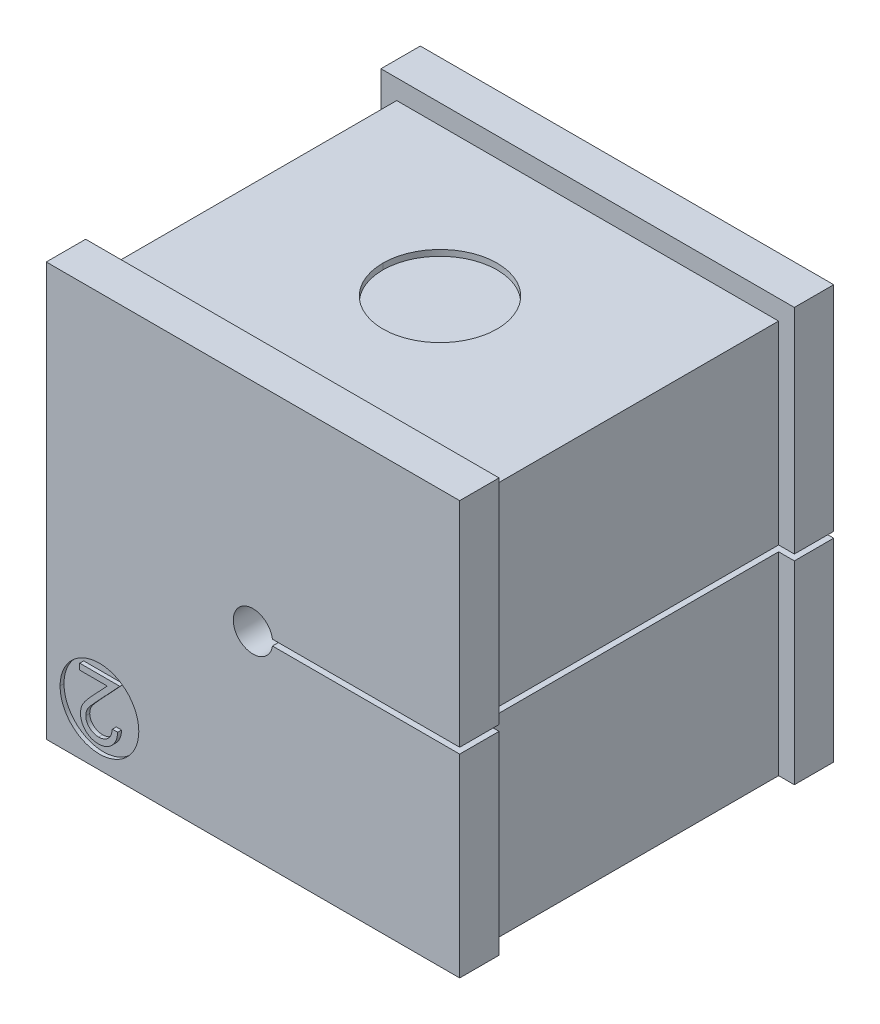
ISO-10303-21;
HEADER;
FILE_DESCRIPTION(('STEP AP214'),'2;1');
FILE_NAME('part.step','',(''),(''),'','','');
FILE_SCHEMA(('AUTOMOTIVE_DESIGN { 1 0 10303 214 1 1 1 1 }'));
ENDSEC;
DATA;
#1=APPLICATION_CONTEXT('core data for automotive mechanical design processes');
#2=APPLICATION_PROTOCOL_DEFINITION('international standard','automotive_design',2000,#1);
#3=PRODUCT_CONTEXT('',#1,'mechanical');
#4=PRODUCT('Part','Part','',(#3));
#5=PRODUCT_RELATED_PRODUCT_CATEGORY('part','',(#4));
#6=PRODUCT_DEFINITION_FORMATION('','',#4);
#7=PRODUCT_DEFINITION_CONTEXT('part definition',#1,'design');
#8=PRODUCT_DEFINITION('design','',#6,#7);
#9=PRODUCT_DEFINITION_SHAPE('','',#8);
#10=(LENGTH_UNIT() NAMED_UNIT(*) SI_UNIT(.MILLI.,.METRE.));
#11=(NAMED_UNIT(*) PLANE_ANGLE_UNIT() SI_UNIT($,.RADIAN.));
#12=(NAMED_UNIT(*) SI_UNIT($,.STERADIAN.) SOLID_ANGLE_UNIT());
#13=UNCERTAINTY_MEASURE_WITH_UNIT(LENGTH_MEASURE(1.E-05),#10,'distance_accuracy_value','');
#14=(GEOMETRIC_REPRESENTATION_CONTEXT(3) GLOBAL_UNCERTAINTY_ASSIGNED_CONTEXT((#13)) GLOBAL_UNIT_ASSIGNED_CONTEXT((#10,
#11,#12)) REPRESENTATION_CONTEXT('',''));
#15=CARTESIAN_POINT('',(0.,0.,0.));
#16=DIRECTION('',(0.,0.,1.));
#17=DIRECTION('',(1.,0.,0.));
#18=AXIS2_PLACEMENT_3D('',#15,#16,#17);
#19=CARTESIAN_POINT('',(3.15180335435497,-8.8722612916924,9.5));
#20=DIRECTION('',(0.,-9.42924395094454E-13,-1.));
#21=DIRECTION('',(0.,-1.,9.42924395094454E-13));
#22=AXIS2_PLACEMENT_3D('',#19,#20,#21);
#23=PLANE('',#22);
#24=CARTESIAN_POINT('',(2.65853365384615,-9.06923076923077,9.5));
#25=CARTESIAN_POINT('',(2.68200036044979,-9.06864225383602,9.5));
#26=CARTESIAN_POINT('',(2.72808509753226,-9.06748650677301,9.5));
#27=CARTESIAN_POINT('',(2.79560229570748,-9.0587268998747,9.5));
#28=CARTESIAN_POINT('',(2.86046231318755,-9.04546092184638,9.5));
#29=CARTESIAN_POINT('',(2.9216656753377,-9.02434159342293,9.5));
#30=CARTESIAN_POINT('',(2.98049325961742,-8.99962417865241,9.5));
#31=CARTESIAN_POINT('',(3.03544434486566,-8.96761947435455,9.5));
#32=CARTESIAN_POINT('',(3.0880625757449,-8.93104915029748,9.5));
#33=CARTESIAN_POINT('',(3.13729004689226,-8.88841047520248,9.5));
#34=CARTESIAN_POINT('',(3.18212563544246,-8.84027783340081,9.5));
#35=CARTESIAN_POINT('',(3.22291297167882,-8.78788630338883,9.5));
#36=CARTESIAN_POINT('',(3.25747248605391,-8.7303070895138,9.5));
#37=CARTESIAN_POINT('',(3.28815061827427,-8.66892182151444,9.5));
#38=CARTESIAN_POINT('',(3.31161333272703,-8.60204399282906,9.5));
#39=CARTESIAN_POINT('',(3.33167227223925,-8.5313091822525,9.5));
#40=CARTESIAN_POINT('',(3.34624279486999,-8.45570817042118,9.5));
#41=CARTESIAN_POINT('',(3.35126960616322,-8.40362095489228,9.5));
#42=CARTESIAN_POINT('',(3.35384615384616,-8.37692307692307,9.5));
#43=(BOUNDED_CURVE() B_SPLINE_CURVE(3,(#24,#25,#26,#27,#28,#29,#30,#31,#32,#33,#34,#35,#36,#37,
#38,#39,#40,#41,#42),.UNSPECIFIED.,.F.,.F.) B_SPLINE_CURVE_WITH_KNOTS((4,1,1,1,1,1,1,1,1,1,1,1,
1,1,1,1,4),(0.,0.0644420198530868,0.126553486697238,0.186778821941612,0.245943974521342,
0.304110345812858,0.361785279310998,0.42025540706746,0.479942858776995,0.540286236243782,
0.600712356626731,0.661962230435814,0.724472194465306,0.788881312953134,0.856306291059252,
0.926348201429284,1.),
.UNSPECIFIED.) CURVE() GEOMETRIC_REPRESENTATION_ITEM() RATIONAL_B_SPLINE_CURVE((1.,1.,1.,1.,1.,
1.,1.,1.,1.,1.,1.,1.,1.,1.,1.,1.,1.,1.,1.)) REPRESENTATION_ITEM(''));
#44=CARTESIAN_POINT('',(2.65853365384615,-9.06923076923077,9.5));
#45=VERTEX_POINT('',#44);
#46=CARTESIAN_POINT('',(3.35384615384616,-8.37692307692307,9.5));
#47=VERTEX_POINT('',#46);
#48=EDGE_CURVE('E349',#45,#47,#43,.T.);
#49=ORIENTED_EDGE('',*,*,#48,.F.);
#50=CARTESIAN_POINT('',(2.00769230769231,-8.46105769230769,9.5));
#51=CARTESIAN_POINT('',(2.00823163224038,-8.4815297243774,9.5));
#52=CARTESIAN_POINT('',(2.00929453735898,-8.52187616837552,9.5));
#53=CARTESIAN_POINT('',(2.01885287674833,-8.58099150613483,9.5));
#54=CARTESIAN_POINT('',(2.03289597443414,-8.63823624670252,9.5));
#55=CARTESIAN_POINT('',(2.0545407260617,-8.69290259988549,9.5));
#56=CARTESIAN_POINT('',(2.08054609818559,-8.74606574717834,9.5));
#57=CARTESIAN_POINT('',(2.1137698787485,-8.79610936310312,9.5));
#58=CARTESIAN_POINT('',(2.15173593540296,-8.84473931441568,9.5));
#59=CARTESIAN_POINT('',(2.19577469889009,-8.89028812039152,9.5));
#60=CARTESIAN_POINT('',(2.24412107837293,-8.93201789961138,9.5));
#61=CARTESIAN_POINT('',(2.29520352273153,-8.96898060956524,9.5));
#62=CARTESIAN_POINT('',(2.34924603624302,-8.9998714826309,9.5));
#63=CARTESIAN_POINT('',(2.4060233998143,-9.02519442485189,9.5));
#64=CARTESIAN_POINT('',(2.46537662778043,-9.04505905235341,9.5));
#65=CARTESIAN_POINT('',(2.52742070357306,-9.05882354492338,9.5));
#66=CARTESIAN_POINT('',(2.5919841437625,-9.0674656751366,9.5));
#67=CARTESIAN_POINT('',(2.63606999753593,-9.06863496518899,9.5));
#68=CARTESIAN_POINT('',(2.65853365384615,-9.06923076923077,9.5));
#69=(BOUNDED_CURVE() B_SPLINE_CURVE(3,(#50,#51,#52,#53,#54,#55,#56,#57,#58,#59,#60,#61,#62,#63,
#64,#65,#66,#67,#68),.UNSPECIFIED.,.F.,.F.) B_SPLINE_CURVE_WITH_KNOTS((4,1,1,1,1,1,1,1,1,1,1,1,
1,1,1,1,4),(0.,0.0619690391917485,0.122129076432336,0.180999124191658,0.240162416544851,
0.29986472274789,0.359951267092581,0.421741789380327,0.486545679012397,0.551508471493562,
0.614994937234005,0.677239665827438,0.739714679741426,0.803038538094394,0.866487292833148,
0.931969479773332,1.),
.UNSPECIFIED.) CURVE() GEOMETRIC_REPRESENTATION_ITEM() RATIONAL_B_SPLINE_CURVE((1.,1.,1.,1.,1.,
1.,1.,1.,1.,1.,1.,1.,1.,1.,1.,1.,1.,1.,1.)) REPRESENTATION_ITEM(''));
#70=CARTESIAN_POINT('',(2.00769230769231,-8.46105769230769,9.5));
#71=VERTEX_POINT('',#70);
#72=EDGE_CURVE('E343',#71,#45,#69,.T.);
#73=ORIENTED_EDGE('',*,*,#72,.F.);
#74=CARTESIAN_POINT('',(2.575,-7.54158653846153,9.5));
#75=CARTESIAN_POINT('',(2.54667123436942,-7.57115490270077,9.5));
#76=CARTESIAN_POINT('',(2.49225747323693,-7.62794967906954,9.5));
#77=CARTESIAN_POINT('',(2.41532736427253,-7.7108934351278,9.5));
#78=CARTESIAN_POINT('',(2.34612061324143,-7.78775115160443,9.5));
#79=CARTESIAN_POINT('',(2.28459131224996,-7.85886340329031,9.5));
#80=CARTESIAN_POINT('',(2.23068883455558,-7.92382705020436,9.5));
#81=CARTESIAN_POINT('',(2.18458564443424,-7.98315119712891,9.5));
#82=CARTESIAN_POINT('',(2.14607797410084,-8.03632674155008,9.5));
#83=CARTESIAN_POINT('',(2.10526786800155,-8.09879514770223,9.5));
#84=CARTESIAN_POINT('',(2.06635272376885,-8.17515588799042,9.5));
#85=CARTESIAN_POINT('',(2.03215029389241,-8.26800331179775,9.5));
#86=CARTESIAN_POINT('',(2.01144460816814,-8.36379382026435,9.5));
#87=CARTESIAN_POINT('',(2.0089480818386,-8.42850660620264,9.5));
#88=CARTESIAN_POINT('',(2.00769230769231,-8.46105769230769,9.5));
#89=(BOUNDED_CURVE() B_SPLINE_CURVE(3,(#74,#75,#76,#77,#78,#79,#80,#81,#82,#83,#84,#85,#86,#87,
#88),.UNSPECIFIED.,.F.,.F.) B_SPLINE_CURVE_WITH_KNOTS((4,1,1,1,1,1,1,1,1,1,1,1,4),(0.,
0.110794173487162,0.212812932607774,0.306077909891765,0.390617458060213,0.467232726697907,
0.534450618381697,0.59386680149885,0.644832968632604,0.736220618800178,0.825037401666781,
0.911992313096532,1.),
.UNSPECIFIED.) CURVE() GEOMETRIC_REPRESENTATION_ITEM() RATIONAL_B_SPLINE_CURVE((1.,1.,1.,1.,1.,
1.,1.,1.,1.,1.,1.,1.,1.,1.,1.)) REPRESENTATION_ITEM(''));
#90=CARTESIAN_POINT('',(2.575,-7.54158653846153,9.5));
#91=VERTEX_POINT('',#90);
#92=EDGE_CURVE('E404',#91,#71,#89,.T.);
#93=ORIENTED_EDGE('',*,*,#92,.F.);
#94=DIRECTION('',(-0.683776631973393,-0.729691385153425,0.));
#95=VECTOR('',#94,1.);
#96=CARTESIAN_POINT('',(3.73846153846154,-6.3,9.5));
#97=LINE('',#96,#95);
#98=CARTESIAN_POINT('',(3.73846153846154,-6.3,9.5));
#99=VERTEX_POINT('',#98);
#100=EDGE_CURVE('E403',#99,#91,#97,.T.);
#101=ORIENTED_EDGE('',*,*,#100,.F.);
#102=DIRECTION('',(1.,0.,0.));
#103=VECTOR('',#102,1.);
#104=CARTESIAN_POINT('',(1.7,-6.3,9.5));
#105=LINE('',#104,#103);
#106=CARTESIAN_POINT('',(1.7,-6.3,9.5));
#107=VERTEX_POINT('',#106);
#108=EDGE_CURVE('E410',#107,#99,#105,.T.);
#109=ORIENTED_EDGE('',*,*,#108,.F.);
#110=DIRECTION('',(0.,1.,0.));
#111=VECTOR('',#110,1.);
#112=CARTESIAN_POINT('',(1.7,-6.6076923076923,9.5));
#113=LINE('',#112,#111);
#114=CARTESIAN_POINT('',(1.7,-6.6076923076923,9.5));
#115=VERTEX_POINT('',#114);
#116=EDGE_CURVE('E416',#115,#107,#113,.T.);
#117=ORIENTED_EDGE('',*,*,#116,.F.);
#118=DIRECTION('',(-1.,0.,0.));
#119=VECTOR('',#118,1.);
#120=CARTESIAN_POINT('',(3.09603365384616,-6.6076923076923,9.5));
#121=LINE('',#120,#119);
#122=CARTESIAN_POINT('',(3.09603365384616,-6.6076923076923,9.5));
#123=VERTEX_POINT('',#122);
#124=EDGE_CURVE('E420',#123,#115,#121,.T.);
#125=ORIENTED_EDGE('',*,*,#124,.F.);
#126=DIRECTION('',(0.683740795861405,0.729724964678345,0.));
#127=VECTOR('',#126,1.);
#128=CARTESIAN_POINT('',(2.34543269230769,-7.40877403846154,9.5));
#129=LINE('',#128,#127);
#130=CARTESIAN_POINT('',(2.34543269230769,-7.40877403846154,9.5));
#131=VERTEX_POINT('',#130);
#132=EDGE_CURVE('E382',#131,#123,#129,.T.);
#133=ORIENTED_EDGE('',*,*,#132,.F.);
#134=CARTESIAN_POINT('',(1.73846153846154,-8.48509615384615,9.5));
#135=CARTESIAN_POINT('',(1.73991292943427,-8.44331231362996,9.5));
#136=CARTESIAN_POINT('',(1.74279024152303,-8.3604778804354,9.5));
#137=CARTESIAN_POINT('',(1.76740222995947,-8.23875059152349,9.5));
#138=CARTESIAN_POINT('',(1.80584336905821,-8.12081437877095,9.5));
#139=CARTESIAN_POINT('',(1.85212271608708,-8.02589345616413,9.5));
#140=CARTESIAN_POINT('',(1.89882256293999,-7.94941484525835,9.5));
#141=CARTESIAN_POINT('',(1.94086381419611,-7.88641504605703,9.5));
#142=CARTESIAN_POINT('',(1.99035994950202,-7.81859905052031,9.5));
#143=CARTESIAN_POINT('',(2.04688809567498,-7.74569237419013,9.5));
#144=CARTESIAN_POINT('',(2.11142174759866,-7.66864979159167,9.5));
#145=CARTESIAN_POINT('',(2.18228432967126,-7.58589942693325,9.5));
#146=CARTESIAN_POINT('',(2.26130589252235,-7.49897139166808,9.5));
#147=CARTESIAN_POINT('',(2.31671900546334,-7.43955969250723,9.5));
#148=CARTESIAN_POINT('',(2.34543269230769,-7.40877403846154,9.5));
#149=(BOUNDED_CURVE() B_SPLINE_CURVE(3,(#134,#135,#136,#137,#138,#139,#140,#141,#142,#143,#144,
#145,#146,#147,#148),.UNSPECIFIED.,.F.,.F.) B_SPLINE_CURVE_WITH_KNOTS((4,1,1,1,1,1,1,1,1,1,1,1,
4),(0.,0.0987013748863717,0.195670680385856,0.292419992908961,0.391339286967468,
0.444458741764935,0.504224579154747,0.570347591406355,0.642913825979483,0.722289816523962,
0.807922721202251,0.900470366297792,1.),
.UNSPECIFIED.) CURVE() GEOMETRIC_REPRESENTATION_ITEM() RATIONAL_B_SPLINE_CURVE((1.,1.,1.,1.,1.,
1.,1.,1.,1.,1.,1.,1.,1.,1.,1.)) REPRESENTATION_ITEM(''));
#150=CARTESIAN_POINT('',(1.73846153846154,-8.48509615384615,9.5));
#151=VERTEX_POINT('',#150);
#152=EDGE_CURVE('E93',#151,#131,#149,.T.);
#153=ORIENTED_EDGE('',*,*,#152,.F.);
#154=CARTESIAN_POINT('',(2.64471153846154,-9.37692307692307,9.5));
#155=CARTESIAN_POINT('',(2.6118137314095,-9.3761592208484,9.5));
#156=CARTESIAN_POINT('',(2.54717071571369,-9.37465827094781,9.5));
#157=CARTESIAN_POINT('',(2.45286459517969,-9.36157469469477,9.5));
#158=CARTESIAN_POINT('',(2.36287393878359,-9.34152528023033,9.5));
#159=CARTESIAN_POINT('',(2.27821860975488,-9.31181520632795,9.5));
#160=CARTESIAN_POINT('',(2.19802980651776,-9.27453556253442,9.5));
#161=CARTESIAN_POINT('',(2.12330039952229,-9.22817344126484,9.5));
#162=CARTESIAN_POINT('',(2.0522233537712,-9.17492254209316,9.5));
#163=CARTESIAN_POINT('',(1.98828700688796,-9.11211049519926,9.5));
#164=CARTESIAN_POINT('',(1.92955375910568,-9.04508988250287,9.5));
#165=CARTESIAN_POINT('',(1.8789292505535,-8.97351243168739,9.5));
#166=CARTESIAN_POINT('',(1.83533102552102,-8.8994991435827,9.5));
#167=CARTESIAN_POINT('',(1.79964724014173,-8.82247186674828,9.5));
#168=CARTESIAN_POINT('',(1.7725973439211,-8.742179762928,9.5));
#169=CARTESIAN_POINT('',(1.75255596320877,-8.65939261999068,9.5));
#170=CARTESIAN_POINT('',(1.74109922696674,-8.57315501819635,9.5));
#171=CARTESIAN_POINT('',(1.73935056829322,-8.51477629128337,9.5));
#172=CARTESIAN_POINT('',(1.73846153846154,-8.48509615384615,9.5));
#173=(BOUNDED_CURVE() B_SPLINE_CURVE(3,(#154,#155,#156,#157,#158,#159,#160,#161,#162,#163,#164,
#165,#166,#167,#168,#169,#170,#171,#172),.UNSPECIFIED.,.F.,.F.) B_SPLINE_CURVE_WITH_KNOTS((4,1,
1,1,1,1,1,1,1,1,1,1,1,1,1,1,4),(0.,0.0694796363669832,0.136525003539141,0.200800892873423,
0.263983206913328,0.325711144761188,0.387270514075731,0.449492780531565,0.51295519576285,
0.576266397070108,0.637574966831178,0.697901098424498,0.757558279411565,0.816587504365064,
0.876645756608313,0.937285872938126,1.),
.UNSPECIFIED.) CURVE() GEOMETRIC_REPRESENTATION_ITEM() RATIONAL_B_SPLINE_CURVE((1.,1.,1.,1.,1.,
1.,1.,1.,1.,1.,1.,1.,1.,1.,1.,1.,1.,1.,1.)) REPRESENTATION_ITEM(''));
#174=CARTESIAN_POINT('',(2.64471153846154,-9.37692307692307,9.5));
#175=VERTEX_POINT('',#174);
#176=EDGE_CURVE('E82',#175,#151,#173,.T.);
#177=ORIENTED_EDGE('',*,*,#176,.F.);
#178=CARTESIAN_POINT('',(3.62307692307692,-8.37692307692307,9.5));
#179=CARTESIAN_POINT('',(3.62132251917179,-8.41264115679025,9.5));
#180=CARTESIAN_POINT('',(3.61787691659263,-8.48279051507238,9.5));
#181=CARTESIAN_POINT('',(3.60173415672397,-8.58506565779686,9.5));
#182=CARTESIAN_POINT('',(3.57865727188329,-8.68283593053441,9.5));
#183=CARTESIAN_POINT('',(3.54595194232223,-8.77526313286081,9.5));
#184=CARTESIAN_POINT('',(3.50556371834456,-8.86345138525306,9.5));
#185=CARTESIAN_POINT('',(3.45611684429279,-8.94622964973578,9.5));
#186=CARTESIAN_POINT('',(3.39866544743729,-9.02441949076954,9.5));
#187=CARTESIAN_POINT('',(3.33331492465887,-9.09654051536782,9.5));
#188=CARTESIAN_POINT('',(3.26240358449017,-9.16246814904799,9.5));
#189=CARTESIAN_POINT('',(3.18635629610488,-9.22000250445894,9.5));
#190=CARTESIAN_POINT('',(3.10595468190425,-9.26805723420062,9.5));
#191=CARTESIAN_POINT('',(3.0218961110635,-9.30844834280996,9.5));
#192=CARTESIAN_POINT('',(2.93320842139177,-9.33872996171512,9.5));
#193=CARTESIAN_POINT('',(2.84073936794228,-9.36120829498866,9.5));
#194=CARTESIAN_POINT('',(2.74407100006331,-9.37473015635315,9.5));
#195=CARTESIAN_POINT('',(2.67820819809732,-9.37618378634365,9.5));
#196=CARTESIAN_POINT('',(2.64471153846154,-9.37692307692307,9.5));
#197=(BOUNDED_CURVE() B_SPLINE_CURVE(3,(#178,#179,#180,#181,#182,#183,#184,#185,#186,#187,#188,
#189,#190,#191,#192,#193,#194,#195,#196),.UNSPECIFIED.,.F.,.F.) B_SPLINE_CURVE_WITH_KNOTS((4,1,
1,1,1,1,1,1,1,1,1,1,1,1,1,1,4),(0.,0.0687985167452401,0.135118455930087,0.199001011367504,
0.261933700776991,0.323531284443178,0.385434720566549,0.447215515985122,0.510018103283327,
0.572510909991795,0.633364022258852,0.693216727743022,0.752555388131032,0.81255822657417,
0.873260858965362,0.935542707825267,1.),
.UNSPECIFIED.) CURVE() GEOMETRIC_REPRESENTATION_ITEM() RATIONAL_B_SPLINE_CURVE((1.,1.,1.,1.,1.,
1.,1.,1.,1.,1.,1.,1.,1.,1.,1.,1.,1.,1.,1.)) REPRESENTATION_ITEM(''));
#198=CARTESIAN_POINT('',(3.62307692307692,-8.37692307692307,9.5));
#199=VERTEX_POINT('',#198);
#200=EDGE_CURVE('E25',#199,#175,#197,.T.);
#201=ORIENTED_EDGE('',*,*,#200,.F.);
#202=DIRECTION('',(1.,0.,0.));
#203=VECTOR('',#202,1.);
#204=CARTESIAN_POINT('',(3.35384615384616,-8.37692307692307,9.5));
#205=LINE('',#204,#203);
#206=EDGE_CURVE('E9',#47,#199,#205,.T.);
#207=ORIENTED_EDGE('',*,*,#206,.F.);
#208=EDGE_LOOP('',(#49,#73,#93,#101,#109,#117,#125,#133,#153,#177,#201,#207));
#209=FACE_BOUND('',#208,.T.);
#210=ADVANCED_FACE('F15',(#209),#23,.F.);
#211=CARTESIAN_POINT('',(3.35384615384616,-8.37692307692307,9.5));
#212=DIRECTION('',(0.,1.,0.));
#213=DIRECTION('',(1.,0.,0.));
#214=AXIS2_PLACEMENT_3D('',#211,#212,#213);
#215=PLANE('',#214);
#216=DIRECTION('',(1.,0.,0.));
#217=VECTOR('',#216,1.);
#218=CARTESIAN_POINT('',(3.35384615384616,-8.37692307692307,9.3));
#219=LINE('',#218,#217);
#220=CARTESIAN_POINT('',(3.35384615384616,-8.37692307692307,9.3));
#221=VERTEX_POINT('',#220);
#222=CARTESIAN_POINT('',(3.62307692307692,-8.37692307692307,9.3));
#223=VERTEX_POINT('',#222);
#224=EDGE_CURVE('E366',#221,#223,#219,.T.);
#225=ORIENTED_EDGE('',*,*,#224,.F.);
#226=DIRECTION('',(0.,0.,-1.));
#227=VECTOR('',#226,1.);
#228=CARTESIAN_POINT('',(3.35384615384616,-8.37692307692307,9.5));
#229=LINE('',#228,#227);
#230=EDGE_CURVE('E363',#47,#221,#229,.T.);
#231=ORIENTED_EDGE('',*,*,#230,.F.);
#232=ORIENTED_EDGE('',*,*,#206,.T.);
#233=DIRECTION('',(0.,0.,-1.));
#234=VECTOR('',#233,1.);
#235=CARTESIAN_POINT('',(3.62307692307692,-8.37692307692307,9.5));
#236=LINE('',#235,#234);
#237=EDGE_CURVE('E389',#199,#223,#236,.T.);
#238=ORIENTED_EDGE('',*,*,#237,.T.);
#239=EDGE_LOOP('',(#225,#231,#232,#238));
#240=FACE_BOUND('',#239,.T.);
#241=ADVANCED_FACE('F17',(#240),#215,.T.);
#242=CARTESIAN_POINT('',(3.62307692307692,-8.37692307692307,9.5));
#243=CARTESIAN_POINT('',(3.62307692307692,-8.37692307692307,9.3));
#244=CARTESIAN_POINT('',(3.62132251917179,-8.41264115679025,9.5));
#245=CARTESIAN_POINT('',(3.62132251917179,-8.41264115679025,9.3));
#246=CARTESIAN_POINT('',(3.61787691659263,-8.48279051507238,9.5));
#247=CARTESIAN_POINT('',(3.61787691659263,-8.48279051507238,9.3));
#248=CARTESIAN_POINT('',(3.60173415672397,-8.58506565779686,9.5));
#249=CARTESIAN_POINT('',(3.60173415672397,-8.58506565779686,9.3));
#250=CARTESIAN_POINT('',(3.57865727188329,-8.68283593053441,9.5));
#251=CARTESIAN_POINT('',(3.57865727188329,-8.68283593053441,9.3));
#252=CARTESIAN_POINT('',(3.54595194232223,-8.77526313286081,9.5));
#253=CARTESIAN_POINT('',(3.54595194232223,-8.77526313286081,9.3));
#254=CARTESIAN_POINT('',(3.50556371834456,-8.86345138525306,9.5));
#255=CARTESIAN_POINT('',(3.50556371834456,-8.86345138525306,9.3));
#256=CARTESIAN_POINT('',(3.45611684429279,-8.94622964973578,9.5));
#257=CARTESIAN_POINT('',(3.45611684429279,-8.94622964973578,9.3));
#258=CARTESIAN_POINT('',(3.39866544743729,-9.02441949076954,9.5));
#259=CARTESIAN_POINT('',(3.39866544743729,-9.02441949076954,9.3));
#260=CARTESIAN_POINT('',(3.33331492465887,-9.09654051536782,9.5));
#261=CARTESIAN_POINT('',(3.33331492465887,-9.09654051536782,9.3));
#262=CARTESIAN_POINT('',(3.26240358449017,-9.16246814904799,9.5));
#263=CARTESIAN_POINT('',(3.26240358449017,-9.16246814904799,9.3));
#264=CARTESIAN_POINT('',(3.18635629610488,-9.22000250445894,9.5));
#265=CARTESIAN_POINT('',(3.18635629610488,-9.22000250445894,9.3));
#266=CARTESIAN_POINT('',(3.10595468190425,-9.26805723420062,9.5));
#267=CARTESIAN_POINT('',(3.10595468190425,-9.26805723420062,9.3));
#268=CARTESIAN_POINT('',(3.0218961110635,-9.30844834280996,9.5));
#269=CARTESIAN_POINT('',(3.0218961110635,-9.30844834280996,9.3));
#270=CARTESIAN_POINT('',(2.93320842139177,-9.33872996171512,9.5));
#271=CARTESIAN_POINT('',(2.93320842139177,-9.33872996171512,9.3));
#272=CARTESIAN_POINT('',(2.84073936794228,-9.36120829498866,9.5));
#273=CARTESIAN_POINT('',(2.84073936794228,-9.36120829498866,9.3));
#274=CARTESIAN_POINT('',(2.74407100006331,-9.37473015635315,9.5));
#275=CARTESIAN_POINT('',(2.74407100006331,-9.37473015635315,9.3));
#276=CARTESIAN_POINT('',(2.67820819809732,-9.37618378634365,9.5));
#277=CARTESIAN_POINT('',(2.67820819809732,-9.37618378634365,9.3));
#278=CARTESIAN_POINT('',(2.64471153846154,-9.37692307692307,9.5));
#279=CARTESIAN_POINT('',(2.64471153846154,-9.37692307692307,9.3));
#280=(BOUNDED_SURFACE() B_SPLINE_SURFACE(3,1,((#242,#243),(#244,#245),(#246,#247),(#248,#249),
(#250,#251),(#252,#253),(#254,#255),(#256,#257),(#258,#259),(#260,#261),(#262,#263),(#264,#265),
(#266,#267),(#268,#269),(#270,#271),(#272,#273),(#274,#275),(#276,#277),(#278,#279)),
.UNSPECIFIED.,.F.,.F.,.F.) B_SPLINE_SURFACE_WITH_KNOTS((4,1,1,1,1,1,1,1,1,1,1,1,1,1,1,1,4),(2,
2),(0.,0.0687985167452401,0.135118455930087,0.199001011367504,0.261933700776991,
0.323531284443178,0.385434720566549,0.447215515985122,0.510018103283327,0.572510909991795,
0.633364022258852,0.693216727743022,0.752555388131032,0.81255822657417,0.873260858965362,
0.935542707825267,1.),(0.,1.),
.UNSPECIFIED.) GEOMETRIC_REPRESENTATION_ITEM() RATIONAL_B_SPLINE_SURFACE(((1.,1.),(1.,1.),(1.,
1.),(1.,1.),(1.,1.),(1.,1.),(1.,1.),(1.,1.),(1.,1.),(1.,1.),(1.,1.),(1.,1.),(1.,1.),(1.,1.),(1.,
1.),(1.,1.),(1.,1.),(1.,1.),(1.,1.))) REPRESENTATION_ITEM('') SURFACE());
#281=CARTESIAN_POINT('',(3.62307692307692,-8.37692307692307,9.3));
#282=CARTESIAN_POINT('',(3.62132251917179,-8.41264115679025,9.3));
#283=CARTESIAN_POINT('',(3.61787691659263,-8.48279051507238,9.3));
#284=CARTESIAN_POINT('',(3.60173415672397,-8.58506565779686,9.3));
#285=CARTESIAN_POINT('',(3.57865727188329,-8.68283593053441,9.3));
#286=CARTESIAN_POINT('',(3.54595194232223,-8.77526313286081,9.3));
#287=CARTESIAN_POINT('',(3.50556371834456,-8.86345138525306,9.3));
#288=CARTESIAN_POINT('',(3.45611684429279,-8.94622964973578,9.3));
#289=CARTESIAN_POINT('',(3.39866544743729,-9.02441949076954,9.3));
#290=CARTESIAN_POINT('',(3.33331492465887,-9.09654051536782,9.3));
#291=CARTESIAN_POINT('',(3.26240358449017,-9.16246814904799,9.3));
#292=CARTESIAN_POINT('',(3.18635629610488,-9.22000250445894,9.3));
#293=CARTESIAN_POINT('',(3.10595468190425,-9.26805723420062,9.3));
#294=CARTESIAN_POINT('',(3.0218961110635,-9.30844834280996,9.3));
#295=CARTESIAN_POINT('',(2.93320842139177,-9.33872996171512,9.3));
#296=CARTESIAN_POINT('',(2.84073936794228,-9.36120829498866,9.3));
#297=CARTESIAN_POINT('',(2.74407100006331,-9.37473015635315,9.3));
#298=CARTESIAN_POINT('',(2.67820819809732,-9.37618378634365,9.3));
#299=CARTESIAN_POINT('',(2.64471153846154,-9.37692307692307,9.3));
#300=(BOUNDED_CURVE() B_SPLINE_CURVE(3,(#281,#282,#283,#284,#285,#286,#287,#288,#289,#290,#291,
#292,#293,#294,#295,#296,#297,#298,#299),.UNSPECIFIED.,.F.,.F.) B_SPLINE_CURVE_WITH_KNOTS((4,1,
1,1,1,1,1,1,1,1,1,1,1,1,1,1,4),(0.,0.0687985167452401,0.135118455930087,0.199001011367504,
0.261933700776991,0.323531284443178,0.385434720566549,0.447215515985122,0.510018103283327,
0.572510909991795,0.633364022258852,0.693216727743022,0.752555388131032,0.81255822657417,
0.873260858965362,0.935542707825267,1.),
.UNSPECIFIED.) CURVE() GEOMETRIC_REPRESENTATION_ITEM() RATIONAL_B_SPLINE_CURVE((1.,1.,1.,1.,1.,
1.,1.,1.,1.,1.,1.,1.,1.,1.,1.,1.,1.,1.,1.)) REPRESENTATION_ITEM(''));
#301=CARTESIAN_POINT('',(2.64471153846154,-9.37692307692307,9.3));
#302=VERTEX_POINT('',#301);
#303=EDGE_CURVE('E373',#223,#302,#300,.T.);
#304=DIRECTION('',(0.,0.,-1.));
#305=VECTOR('',#304,1.);
#306=CARTESIAN_POINT('',(2.64471153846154,-9.37692307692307,9.5));
#307=LINE('',#306,#305);
#308=EDGE_CURVE('E428',#175,#302,#307,.T.);
#309=ORIENTED_EDGE('',*,*,#303,.F.);
#310=ORIENTED_EDGE('',*,*,#237,.F.);
#311=ORIENTED_EDGE('',*,*,#200,.T.);
#312=ORIENTED_EDGE('',*,*,#308,.T.);
#313=EDGE_LOOP('',(#309,#310,#311,#312));
#314=FACE_BOUND('',#313,.T.);
#315=ADVANCED_FACE('F819',(#314),#280,.T.);
#316=CARTESIAN_POINT('',(2.64471153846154,-9.37692307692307,9.5));
#317=CARTESIAN_POINT('',(2.64471153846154,-9.37692307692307,9.3));
#318=CARTESIAN_POINT('',(2.6118137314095,-9.3761592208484,9.5));
#319=CARTESIAN_POINT('',(2.6118137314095,-9.3761592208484,9.3));
#320=CARTESIAN_POINT('',(2.54717071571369,-9.37465827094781,9.5));
#321=CARTESIAN_POINT('',(2.54717071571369,-9.37465827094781,9.3));
#322=CARTESIAN_POINT('',(2.45286459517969,-9.36157469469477,9.5));
#323=CARTESIAN_POINT('',(2.45286459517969,-9.36157469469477,9.3));
#324=CARTESIAN_POINT('',(2.36287393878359,-9.34152528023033,9.5));
#325=CARTESIAN_POINT('',(2.36287393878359,-9.34152528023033,9.3));
#326=CARTESIAN_POINT('',(2.27821860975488,-9.31181520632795,9.5));
#327=CARTESIAN_POINT('',(2.27821860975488,-9.31181520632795,9.3));
#328=CARTESIAN_POINT('',(2.19802980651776,-9.27453556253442,9.5));
#329=CARTESIAN_POINT('',(2.19802980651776,-9.27453556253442,9.3));
#330=CARTESIAN_POINT('',(2.12330039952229,-9.22817344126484,9.5));
#331=CARTESIAN_POINT('',(2.12330039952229,-9.22817344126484,9.3));
#332=CARTESIAN_POINT('',(2.0522233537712,-9.17492254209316,9.5));
#333=CARTESIAN_POINT('',(2.0522233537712,-9.17492254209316,9.3));
#334=CARTESIAN_POINT('',(1.98828700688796,-9.11211049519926,9.5));
#335=CARTESIAN_POINT('',(1.98828700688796,-9.11211049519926,9.3));
#336=CARTESIAN_POINT('',(1.92955375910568,-9.04508988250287,9.5));
#337=CARTESIAN_POINT('',(1.92955375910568,-9.04508988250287,9.3));
#338=CARTESIAN_POINT('',(1.8789292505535,-8.97351243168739,9.5));
#339=CARTESIAN_POINT('',(1.8789292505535,-8.97351243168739,9.3));
#340=CARTESIAN_POINT('',(1.83533102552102,-8.8994991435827,9.5));
#341=CARTESIAN_POINT('',(1.83533102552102,-8.8994991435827,9.3));
#342=CARTESIAN_POINT('',(1.79964724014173,-8.82247186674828,9.5));
#343=CARTESIAN_POINT('',(1.79964724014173,-8.82247186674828,9.3));
#344=CARTESIAN_POINT('',(1.7725973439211,-8.742179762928,9.5));
#345=CARTESIAN_POINT('',(1.7725973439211,-8.742179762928,9.3));
#346=CARTESIAN_POINT('',(1.75255596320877,-8.65939261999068,9.5));
#347=CARTESIAN_POINT('',(1.75255596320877,-8.65939261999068,9.3));
#348=CARTESIAN_POINT('',(1.74109922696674,-8.57315501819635,9.5));
#349=CARTESIAN_POINT('',(1.74109922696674,-8.57315501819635,9.3));
#350=CARTESIAN_POINT('',(1.73935056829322,-8.51477629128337,9.5));
#351=CARTESIAN_POINT('',(1.73935056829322,-8.51477629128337,9.3));
#352=CARTESIAN_POINT('',(1.73846153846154,-8.48509615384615,9.5));
#353=CARTESIAN_POINT('',(1.73846153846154,-8.48509615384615,9.3));
#354=(BOUNDED_SURFACE() B_SPLINE_SURFACE(3,1,((#316,#317),(#318,#319),(#320,#321),(#322,#323),
(#324,#325),(#326,#327),(#328,#329),(#330,#331),(#332,#333),(#334,#335),(#336,#337),(#338,#339),
(#340,#341),(#342,#343),(#344,#345),(#346,#347),(#348,#349),(#350,#351),(#352,#353)),
.UNSPECIFIED.,.F.,.F.,.F.) B_SPLINE_SURFACE_WITH_KNOTS((4,1,1,1,1,1,1,1,1,1,1,1,1,1,1,1,4),(2,
2),(0.,0.0694796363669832,0.136525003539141,0.200800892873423,0.263983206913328,
0.325711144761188,0.387270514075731,0.449492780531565,0.51295519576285,0.576266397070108,
0.637574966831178,0.697901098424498,0.757558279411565,0.816587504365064,0.876645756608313,
0.937285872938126,1.),(0.,1.),
.UNSPECIFIED.) GEOMETRIC_REPRESENTATION_ITEM() RATIONAL_B_SPLINE_SURFACE(((1.,1.),(1.,1.),(1.,
1.),(1.,1.),(1.,1.),(1.,1.),(1.,1.),(1.,1.),(1.,1.),(1.,1.),(1.,1.),(1.,1.),(1.,1.),(1.,1.),(1.,
1.),(1.,1.),(1.,1.),(1.,1.),(1.,1.))) REPRESENTATION_ITEM('') SURFACE());
#355=CARTESIAN_POINT('',(2.64471153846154,-9.37692307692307,9.3));
#356=CARTESIAN_POINT('',(2.6118137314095,-9.3761592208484,9.3));
#357=CARTESIAN_POINT('',(2.54717071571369,-9.37465827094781,9.3));
#358=CARTESIAN_POINT('',(2.45286459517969,-9.36157469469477,9.3));
#359=CARTESIAN_POINT('',(2.36287393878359,-9.34152528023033,9.3));
#360=CARTESIAN_POINT('',(2.27821860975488,-9.31181520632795,9.3));
#361=CARTESIAN_POINT('',(2.19802980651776,-9.27453556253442,9.3));
#362=CARTESIAN_POINT('',(2.12330039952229,-9.22817344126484,9.3));
#363=CARTESIAN_POINT('',(2.0522233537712,-9.17492254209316,9.3));
#364=CARTESIAN_POINT('',(1.98828700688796,-9.11211049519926,9.3));
#365=CARTESIAN_POINT('',(1.92955375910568,-9.04508988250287,9.3));
#366=CARTESIAN_POINT('',(1.8789292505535,-8.97351243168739,9.3));
#367=CARTESIAN_POINT('',(1.83533102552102,-8.8994991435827,9.3));
#368=CARTESIAN_POINT('',(1.79964724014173,-8.82247186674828,9.3));
#369=CARTESIAN_POINT('',(1.7725973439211,-8.742179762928,9.3));
#370=CARTESIAN_POINT('',(1.75255596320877,-8.65939261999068,9.3));
#371=CARTESIAN_POINT('',(1.74109922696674,-8.57315501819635,9.3));
#372=CARTESIAN_POINT('',(1.73935056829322,-8.51477629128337,9.3));
#373=CARTESIAN_POINT('',(1.73846153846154,-8.48509615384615,9.3));
#374=(BOUNDED_CURVE() B_SPLINE_CURVE(3,(#355,#356,#357,#358,#359,#360,#361,#362,#363,#364,#365,
#366,#367,#368,#369,#370,#371,#372,#373),.UNSPECIFIED.,.F.,.F.) B_SPLINE_CURVE_WITH_KNOTS((4,1,
1,1,1,1,1,1,1,1,1,1,1,1,1,1,4),(0.,0.0694796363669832,0.136525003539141,0.200800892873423,
0.263983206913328,0.325711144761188,0.387270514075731,0.449492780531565,0.51295519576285,
0.576266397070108,0.637574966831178,0.697901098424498,0.757558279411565,0.816587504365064,
0.876645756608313,0.937285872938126,1.),
.UNSPECIFIED.) CURVE() GEOMETRIC_REPRESENTATION_ITEM() RATIONAL_B_SPLINE_CURVE((1.,1.,1.,1.,1.,
1.,1.,1.,1.,1.,1.,1.,1.,1.,1.,1.,1.,1.,1.)) REPRESENTATION_ITEM(''));
#375=CARTESIAN_POINT('',(1.73846153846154,-8.48509615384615,9.3));
#376=VERTEX_POINT('',#375);
#377=EDGE_CURVE('E476',#302,#376,#374,.T.);
#378=DIRECTION('',(0.,0.,-1.));
#379=VECTOR('',#378,1.);
#380=CARTESIAN_POINT('',(1.73846153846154,-8.48509615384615,9.5));
#381=LINE('',#380,#379);
#382=EDGE_CURVE('E421',#151,#376,#381,.T.);
#383=ORIENTED_EDGE('',*,*,#377,.F.);
#384=ORIENTED_EDGE('',*,*,#308,.F.);
#385=ORIENTED_EDGE('',*,*,#176,.T.);
#386=ORIENTED_EDGE('',*,*,#382,.T.);
#387=EDGE_LOOP('',(#383,#384,#385,#386));
#388=FACE_BOUND('',#387,.T.);
#389=ADVANCED_FACE('F787',(#388),#354,.T.);
#390=CARTESIAN_POINT('',(1.73846153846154,-8.48509615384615,9.5));
#391=CARTESIAN_POINT('',(1.73846153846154,-8.48509615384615,9.3));
#392=CARTESIAN_POINT('',(1.73991292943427,-8.44331231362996,9.5));
#393=CARTESIAN_POINT('',(1.73991292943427,-8.44331231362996,9.3));
#394=CARTESIAN_POINT('',(1.74279024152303,-8.3604778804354,9.5));
#395=CARTESIAN_POINT('',(1.74279024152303,-8.3604778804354,9.3));
#396=CARTESIAN_POINT('',(1.76740222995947,-8.23875059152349,9.5));
#397=CARTESIAN_POINT('',(1.76740222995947,-8.23875059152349,9.3));
#398=CARTESIAN_POINT('',(1.80584336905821,-8.12081437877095,9.5));
#399=CARTESIAN_POINT('',(1.80584336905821,-8.12081437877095,9.3));
#400=CARTESIAN_POINT('',(1.85212271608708,-8.02589345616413,9.5));
#401=CARTESIAN_POINT('',(1.85212271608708,-8.02589345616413,9.3));
#402=CARTESIAN_POINT('',(1.89882256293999,-7.94941484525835,9.5));
#403=CARTESIAN_POINT('',(1.89882256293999,-7.94941484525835,9.3));
#404=CARTESIAN_POINT('',(1.94086381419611,-7.88641504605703,9.5));
#405=CARTESIAN_POINT('',(1.94086381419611,-7.88641504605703,9.3));
#406=CARTESIAN_POINT('',(1.99035994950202,-7.81859905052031,9.5));
#407=CARTESIAN_POINT('',(1.99035994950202,-7.81859905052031,9.3));
#408=CARTESIAN_POINT('',(2.04688809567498,-7.74569237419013,9.5));
#409=CARTESIAN_POINT('',(2.04688809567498,-7.74569237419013,9.3));
#410=CARTESIAN_POINT('',(2.11142174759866,-7.66864979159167,9.5));
#411=CARTESIAN_POINT('',(2.11142174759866,-7.66864979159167,9.3));
#412=CARTESIAN_POINT('',(2.18228432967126,-7.58589942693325,9.5));
#413=CARTESIAN_POINT('',(2.18228432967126,-7.58589942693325,9.3));
#414=CARTESIAN_POINT('',(2.26130589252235,-7.49897139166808,9.5));
#415=CARTESIAN_POINT('',(2.26130589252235,-7.49897139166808,9.3));
#416=CARTESIAN_POINT('',(2.31671900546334,-7.43955969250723,9.5));
#417=CARTESIAN_POINT('',(2.31671900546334,-7.43955969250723,9.3));
#418=CARTESIAN_POINT('',(2.34543269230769,-7.40877403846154,9.5));
#419=CARTESIAN_POINT('',(2.34543269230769,-7.40877403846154,9.3));
#420=(BOUNDED_SURFACE() B_SPLINE_SURFACE(3,1,((#390,#391),(#392,#393),(#394,#395),(#396,#397),
(#398,#399),(#400,#401),(#402,#403),(#404,#405),(#406,#407),(#408,#409),(#410,#411),(#412,#413),
(#414,#415),(#416,#417),(#418,#419)),.UNSPECIFIED.,.F.,.F.,.F.) B_SPLINE_SURFACE_WITH_KNOTS((4,
1,1,1,1,1,1,1,1,1,1,1,4),(2,2),(0.,0.0987013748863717,0.195670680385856,0.292419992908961,
0.391339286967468,0.444458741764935,0.504224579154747,0.570347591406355,0.642913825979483,
0.722289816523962,0.807922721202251,0.900470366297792,1.),(0.,1.),
.UNSPECIFIED.) GEOMETRIC_REPRESENTATION_ITEM() RATIONAL_B_SPLINE_SURFACE(((1.,1.),(1.,1.),(1.,
1.),(1.,1.),(1.,1.),(1.,1.),(1.,1.),(1.,1.),(1.,1.),(1.,1.),(1.,1.),(1.,1.),(1.,1.),(1.,1.),(1.,1.))) REPRESENTATION_ITEM('') SURFACE());
#421=CARTESIAN_POINT('',(1.73846153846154,-8.48509615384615,9.3));
#422=CARTESIAN_POINT('',(1.73991292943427,-8.44331231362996,9.3));
#423=CARTESIAN_POINT('',(1.74279024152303,-8.3604778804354,9.3));
#424=CARTESIAN_POINT('',(1.76740222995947,-8.23875059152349,9.3));
#425=CARTESIAN_POINT('',(1.80584336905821,-8.12081437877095,9.3));
#426=CARTESIAN_POINT('',(1.85212271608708,-8.02589345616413,9.3));
#427=CARTESIAN_POINT('',(1.89882256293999,-7.94941484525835,9.3));
#428=CARTESIAN_POINT('',(1.94086381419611,-7.88641504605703,9.3));
#429=CARTESIAN_POINT('',(1.99035994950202,-7.81859905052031,9.3));
#430=CARTESIAN_POINT('',(2.04688809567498,-7.74569237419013,9.3));
#431=CARTESIAN_POINT('',(2.11142174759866,-7.66864979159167,9.3));
#432=CARTESIAN_POINT('',(2.18228432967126,-7.58589942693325,9.3));
#433=CARTESIAN_POINT('',(2.26130589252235,-7.49897139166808,9.3));
#434=CARTESIAN_POINT('',(2.31671900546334,-7.43955969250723,9.3));
#435=CARTESIAN_POINT('',(2.34543269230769,-7.40877403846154,9.3));
#436=(BOUNDED_CURVE() B_SPLINE_CURVE(3,(#421,#422,#423,#424,#425,#426,#427,#428,#429,#430,#431,
#432,#433,#434,#435),.UNSPECIFIED.,.F.,.F.) B_SPLINE_CURVE_WITH_KNOTS((4,1,1,1,1,1,1,1,1,1,1,1,
4),(0.,0.0987013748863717,0.195670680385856,0.292419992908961,0.391339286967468,
0.444458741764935,0.504224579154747,0.570347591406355,0.642913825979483,0.722289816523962,
0.807922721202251,0.900470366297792,1.),
.UNSPECIFIED.) CURVE() GEOMETRIC_REPRESENTATION_ITEM() RATIONAL_B_SPLINE_CURVE((1.,1.,1.,1.,1.,
1.,1.,1.,1.,1.,1.,1.,1.,1.,1.)) REPRESENTATION_ITEM(''));
#437=CARTESIAN_POINT('',(2.34543269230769,-7.40877403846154,9.3));
#438=VERTEX_POINT('',#437);
#439=EDGE_CURVE('E460',#376,#438,#436,.T.);
#440=DIRECTION('',(0.,0.,-1.));
#441=VECTOR('',#440,1.);
#442=CARTESIAN_POINT('',(2.34543269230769,-7.40877403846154,9.5));
#443=LINE('',#442,#441);
#444=EDGE_CURVE('E417',#131,#438,#443,.T.);
#445=ORIENTED_EDGE('',*,*,#439,.F.);
#446=ORIENTED_EDGE('',*,*,#382,.F.);
#447=ORIENTED_EDGE('',*,*,#152,.T.);
#448=ORIENTED_EDGE('',*,*,#444,.T.);
#449=EDGE_LOOP('',(#445,#446,#447,#448));
#450=FACE_BOUND('',#449,.T.);
#451=ADVANCED_FACE('F788',(#450),#420,.T.);
#452=CARTESIAN_POINT('',(2.34543269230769,-7.40877403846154,9.5));
#453=DIRECTION('',(-0.729724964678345,0.683740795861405,0.));
#454=DIRECTION('',(0.,0.,1.));
#455=AXIS2_PLACEMENT_3D('',#452,#453,#454);
#456=PLANE('',#455);
#457=DIRECTION('',(0.683740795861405,0.729724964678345,0.));
#458=VECTOR('',#457,1.);
#459=CARTESIAN_POINT('',(2.34543269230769,-7.40877403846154,9.3));
#460=LINE('',#459,#458);
#461=CARTESIAN_POINT('',(3.09603365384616,-6.6076923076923,9.3));
#462=VERTEX_POINT('',#461);
#463=EDGE_CURVE('E455',#438,#462,#460,.T.);
#464=ORIENTED_EDGE('',*,*,#463,.F.);
#465=ORIENTED_EDGE('',*,*,#444,.F.);
#466=ORIENTED_EDGE('',*,*,#132,.T.);
#467=DIRECTION('',(0.,0.,-1.));
#468=VECTOR('',#467,1.);
#469=CARTESIAN_POINT('',(3.09603365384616,-6.6076923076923,9.5));
#470=LINE('',#469,#468);
#471=EDGE_CURVE('E484',#123,#462,#470,.T.);
#472=ORIENTED_EDGE('',*,*,#471,.T.);
#473=EDGE_LOOP('',(#464,#465,#466,#472));
#474=FACE_BOUND('',#473,.T.);
#475=ADVANCED_FACE('F792',(#474),#456,.T.);
#476=CARTESIAN_POINT('',(3.09603365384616,-6.6076923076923,9.5));
#477=DIRECTION('',(0.,-1.,0.));
#478=DIRECTION('',(0.,0.,-1.));
#479=AXIS2_PLACEMENT_3D('',#476,#477,#478);
#480=PLANE('',#479);
#481=DIRECTION('',(-1.,0.,0.));
#482=VECTOR('',#481,1.);
#483=CARTESIAN_POINT('',(3.09603365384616,-6.6076923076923,9.3));
#484=LINE('',#483,#482);
#485=CARTESIAN_POINT('',(1.7,-6.6076923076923,9.3));
#486=VERTEX_POINT('',#485);
#487=EDGE_CURVE('E459',#462,#486,#484,.T.);
#488=ORIENTED_EDGE('',*,*,#487,.F.);
#489=ORIENTED_EDGE('',*,*,#471,.F.);
#490=ORIENTED_EDGE('',*,*,#124,.T.);
#491=DIRECTION('',(0.,0.,-1.));
#492=VECTOR('',#491,1.);
#493=CARTESIAN_POINT('',(1.7,-6.6076923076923,9.5));
#494=LINE('',#493,#492);
#495=EDGE_CURVE('E413',#115,#486,#494,.T.);
#496=ORIENTED_EDGE('',*,*,#495,.T.);
#497=EDGE_LOOP('',(#488,#489,#490,#496));
#498=FACE_BOUND('',#497,.T.);
#499=ADVANCED_FACE('F797',(#498),#480,.T.);
#500=CARTESIAN_POINT('',(1.7,-6.6076923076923,9.5));
#501=DIRECTION('',(-1.,0.,0.));
#502=DIRECTION('',(0.,0.,1.));
#503=AXIS2_PLACEMENT_3D('',#500,#501,#502);
#504=PLANE('',#503);
#505=DIRECTION('',(0.,1.,0.));
#506=VECTOR('',#505,1.);
#507=CARTESIAN_POINT('',(1.7,-6.6076923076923,9.3));
#508=LINE('',#507,#506);
#509=CARTESIAN_POINT('',(1.7,-6.3,9.3));
#510=VERTEX_POINT('',#509);
#511=EDGE_CURVE('E399',#486,#510,#508,.T.);
#512=ORIENTED_EDGE('',*,*,#511,.F.);
#513=ORIENTED_EDGE('',*,*,#495,.F.);
#514=ORIENTED_EDGE('',*,*,#116,.T.);
#515=DIRECTION('',(0.,0.,-1.));
#516=VECTOR('',#515,1.);
#517=CARTESIAN_POINT('',(1.7,-6.3,9.5));
#518=LINE('',#517,#516);
#519=EDGE_CURVE('E407',#107,#510,#518,.T.);
#520=ORIENTED_EDGE('',*,*,#519,.T.);
#521=EDGE_LOOP('',(#512,#513,#514,#520));
#522=FACE_BOUND('',#521,.T.);
#523=ADVANCED_FACE('F802',(#522),#504,.T.);
#524=CARTESIAN_POINT('',(1.7,-6.3,9.5));
#525=DIRECTION('',(0.,1.,0.));
#526=DIRECTION('',(1.,0.,0.));
#527=AXIS2_PLACEMENT_3D('',#524,#525,#526);
#528=PLANE('',#527);
#529=DIRECTION('',(1.,0.,0.));
#530=VECTOR('',#529,1.);
#531=CARTESIAN_POINT('',(1.7,-6.3,9.3));
#532=LINE('',#531,#530);
#533=CARTESIAN_POINT('',(3.73846153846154,-6.3,9.3));
#534=VERTEX_POINT('',#533);
#535=EDGE_CURVE('E394',#510,#534,#532,.T.);
#536=ORIENTED_EDGE('',*,*,#535,.F.);
#537=ORIENTED_EDGE('',*,*,#519,.F.);
#538=ORIENTED_EDGE('',*,*,#108,.T.);
#539=DIRECTION('',(0.,0.,-1.));
#540=VECTOR('',#539,1.);
#541=CARTESIAN_POINT('',(3.73846153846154,-6.3,9.5));
#542=LINE('',#541,#540);
#543=EDGE_CURVE('E400',#99,#534,#542,.T.);
#544=ORIENTED_EDGE('',*,*,#543,.T.);
#545=EDGE_LOOP('',(#536,#537,#538,#544));
#546=FACE_BOUND('',#545,.T.);
#547=ADVANCED_FACE('F807',(#546),#528,.T.);
#548=CARTESIAN_POINT('',(3.73846153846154,-6.3,9.5));
#549=DIRECTION('',(0.729691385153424,-0.683776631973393,0.));
#550=DIRECTION('',(0.,0.,-1.));
#551=AXIS2_PLACEMENT_3D('',#548,#549,#550);
#552=PLANE('',#551);
#553=DIRECTION('',(-0.683776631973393,-0.729691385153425,0.));
#554=VECTOR('',#553,1.);
#555=CARTESIAN_POINT('',(3.73846153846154,-6.3,9.3));
#556=LINE('',#555,#554);
#557=CARTESIAN_POINT('',(2.575,-7.54158653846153,9.3));
#558=VERTEX_POINT('',#557);
#559=EDGE_CURVE('E398',#534,#558,#556,.T.);
#560=ORIENTED_EDGE('',*,*,#559,.F.);
#561=ORIENTED_EDGE('',*,*,#543,.F.);
#562=ORIENTED_EDGE('',*,*,#100,.T.);
#563=DIRECTION('',(0.,0.,-1.));
#564=VECTOR('',#563,1.);
#565=CARTESIAN_POINT('',(2.575,-7.54158653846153,9.5));
#566=LINE('',#565,#564);
#567=EDGE_CURVE('E560',#91,#558,#566,.T.);
#568=ORIENTED_EDGE('',*,*,#567,.T.);
#569=EDGE_LOOP('',(#560,#561,#562,#568));
#570=FACE_BOUND('',#569,.T.);
#571=ADVANCED_FACE('F811',(#570),#552,.T.);
#572=CARTESIAN_POINT('',(2.575,-7.54158653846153,9.5));
#573=CARTESIAN_POINT('',(2.575,-7.54158653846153,9.3));
#574=CARTESIAN_POINT('',(2.54667123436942,-7.57115490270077,9.5));
#575=CARTESIAN_POINT('',(2.54667123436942,-7.57115490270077,9.3));
#576=CARTESIAN_POINT('',(2.49225747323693,-7.62794967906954,9.5));
#577=CARTESIAN_POINT('',(2.49225747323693,-7.62794967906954,9.3));
#578=CARTESIAN_POINT('',(2.41532736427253,-7.7108934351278,9.5));
#579=CARTESIAN_POINT('',(2.41532736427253,-7.7108934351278,9.3));
#580=CARTESIAN_POINT('',(2.34612061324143,-7.78775115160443,9.5));
#581=CARTESIAN_POINT('',(2.34612061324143,-7.78775115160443,9.3));
#582=CARTESIAN_POINT('',(2.28459131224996,-7.85886340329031,9.5));
#583=CARTESIAN_POINT('',(2.28459131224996,-7.85886340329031,9.3));
#584=CARTESIAN_POINT('',(2.23068883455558,-7.92382705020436,9.5));
#585=CARTESIAN_POINT('',(2.23068883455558,-7.92382705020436,9.3));
#586=CARTESIAN_POINT('',(2.18458564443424,-7.98315119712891,9.5));
#587=CARTESIAN_POINT('',(2.18458564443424,-7.98315119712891,9.3));
#588=CARTESIAN_POINT('',(2.14607797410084,-8.03632674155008,9.5));
#589=CARTESIAN_POINT('',(2.14607797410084,-8.03632674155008,9.3));
#590=CARTESIAN_POINT('',(2.10526786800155,-8.09879514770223,9.5));
#591=CARTESIAN_POINT('',(2.10526786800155,-8.09879514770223,9.3));
#592=CARTESIAN_POINT('',(2.06635272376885,-8.17515588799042,9.5));
#593=CARTESIAN_POINT('',(2.06635272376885,-8.17515588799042,9.3));
#594=CARTESIAN_POINT('',(2.03215029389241,-8.26800331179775,9.5));
#595=CARTESIAN_POINT('',(2.03215029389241,-8.26800331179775,9.3));
#596=CARTESIAN_POINT('',(2.01144460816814,-8.36379382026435,9.5));
#597=CARTESIAN_POINT('',(2.01144460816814,-8.36379382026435,9.3));
#598=CARTESIAN_POINT('',(2.0089480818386,-8.42850660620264,9.5));
#599=CARTESIAN_POINT('',(2.0089480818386,-8.42850660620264,9.3));
#600=CARTESIAN_POINT('',(2.00769230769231,-8.46105769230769,9.5));
#601=CARTESIAN_POINT('',(2.00769230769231,-8.46105769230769,9.3));
#602=(BOUNDED_SURFACE() B_SPLINE_SURFACE(3,1,((#572,#573),(#574,#575),(#576,#577),(#578,#579),
(#580,#581),(#582,#583),(#584,#585),(#586,#587),(#588,#589),(#590,#591),(#592,#593),(#594,#595),
(#596,#597),(#598,#599),(#600,#601)),.UNSPECIFIED.,.F.,.F.,.F.) B_SPLINE_SURFACE_WITH_KNOTS((4,
1,1,1,1,1,1,1,1,1,1,1,4),(2,2),(0.,0.110794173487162,0.212812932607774,0.306077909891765,
0.390617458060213,0.467232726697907,0.534450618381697,0.59386680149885,0.644832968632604,
0.736220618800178,0.825037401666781,0.911992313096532,1.),(0.,1.),
.UNSPECIFIED.) GEOMETRIC_REPRESENTATION_ITEM() RATIONAL_B_SPLINE_SURFACE(((1.,1.),(1.,1.),(1.,
1.),(1.,1.),(1.,1.),(1.,1.),(1.,1.),(1.,1.),(1.,1.),(1.,1.),(1.,1.),(1.,1.),(1.,1.),(1.,1.),(1.,1.))) REPRESENTATION_ITEM('') SURFACE());
#603=CARTESIAN_POINT('',(2.575,-7.54158653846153,9.3));
#604=CARTESIAN_POINT('',(2.54667123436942,-7.57115490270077,9.3));
#605=CARTESIAN_POINT('',(2.49225747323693,-7.62794967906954,9.3));
#606=CARTESIAN_POINT('',(2.41532736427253,-7.7108934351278,9.3));
#607=CARTESIAN_POINT('',(2.34612061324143,-7.78775115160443,9.3));
#608=CARTESIAN_POINT('',(2.28459131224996,-7.85886340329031,9.3));
#609=CARTESIAN_POINT('',(2.23068883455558,-7.92382705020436,9.3));
#610=CARTESIAN_POINT('',(2.18458564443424,-7.98315119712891,9.3));
#611=CARTESIAN_POINT('',(2.14607797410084,-8.03632674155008,9.3));
#612=CARTESIAN_POINT('',(2.10526786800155,-8.09879514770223,9.3));
#613=CARTESIAN_POINT('',(2.06635272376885,-8.17515588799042,9.3));
#614=CARTESIAN_POINT('',(2.03215029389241,-8.26800331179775,9.3));
#615=CARTESIAN_POINT('',(2.01144460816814,-8.36379382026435,9.3));
#616=CARTESIAN_POINT('',(2.0089480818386,-8.42850660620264,9.3));
#617=CARTESIAN_POINT('',(2.00769230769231,-8.46105769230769,9.3));
#618=(BOUNDED_CURVE() B_SPLINE_CURVE(3,(#603,#604,#605,#606,#607,#608,#609,#610,#611,#612,#613,
#614,#615,#616,#617),.UNSPECIFIED.,.F.,.F.) B_SPLINE_CURVE_WITH_KNOTS((4,1,1,1,1,1,1,1,1,1,1,1,
4),(0.,0.110794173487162,0.212812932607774,0.306077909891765,0.390617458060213,
0.467232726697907,0.534450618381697,0.59386680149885,0.644832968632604,0.736220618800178,
0.825037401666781,0.911992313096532,1.),
.UNSPECIFIED.) CURVE() GEOMETRIC_REPRESENTATION_ITEM() RATIONAL_B_SPLINE_CURVE((1.,1.,1.,1.,1.,
1.,1.,1.,1.,1.,1.,1.,1.,1.,1.)) REPRESENTATION_ITEM(''));
#619=CARTESIAN_POINT('',(2.00769230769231,-8.46105769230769,9.3));
#620=VERTEX_POINT('',#619);
#621=EDGE_CURVE('E359',#558,#620,#618,.T.);
#622=DIRECTION('',(0.,0.,-1.));
#623=VECTOR('',#622,1.);
#624=CARTESIAN_POINT('',(2.00769230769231,-8.46105769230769,9.5));
#625=LINE('',#624,#623);
#626=EDGE_CURVE('E581',#71,#620,#625,.T.);
#627=ORIENTED_EDGE('',*,*,#621,.F.);
#628=ORIENTED_EDGE('',*,*,#567,.F.);
#629=ORIENTED_EDGE('',*,*,#92,.T.);
#630=ORIENTED_EDGE('',*,*,#626,.T.);
#631=EDGE_LOOP('',(#627,#628,#629,#630));
#632=FACE_BOUND('',#631,.T.);
#633=ADVANCED_FACE('F816',(#632),#602,.T.);
#634=CARTESIAN_POINT('',(2.00769230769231,-8.46105769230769,9.5));
#635=CARTESIAN_POINT('',(2.00769230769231,-8.46105769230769,9.3));
#636=CARTESIAN_POINT('',(2.00823163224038,-8.4815297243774,9.5));
#637=CARTESIAN_POINT('',(2.00823163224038,-8.4815297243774,9.3));
#638=CARTESIAN_POINT('',(2.00929453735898,-8.52187616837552,9.5));
#639=CARTESIAN_POINT('',(2.00929453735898,-8.52187616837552,9.3));
#640=CARTESIAN_POINT('',(2.01885287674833,-8.58099150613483,9.5));
#641=CARTESIAN_POINT('',(2.01885287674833,-8.58099150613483,9.3));
#642=CARTESIAN_POINT('',(2.03289597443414,-8.63823624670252,9.5));
#643=CARTESIAN_POINT('',(2.03289597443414,-8.63823624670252,9.3));
#644=CARTESIAN_POINT('',(2.0545407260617,-8.69290259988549,9.5));
#645=CARTESIAN_POINT('',(2.0545407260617,-8.69290259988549,9.3));
#646=CARTESIAN_POINT('',(2.08054609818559,-8.74606574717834,9.5));
#647=CARTESIAN_POINT('',(2.08054609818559,-8.74606574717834,9.3));
#648=CARTESIAN_POINT('',(2.1137698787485,-8.79610936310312,9.5));
#649=CARTESIAN_POINT('',(2.1137698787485,-8.79610936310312,9.3));
#650=CARTESIAN_POINT('',(2.15173593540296,-8.84473931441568,9.5));
#651=CARTESIAN_POINT('',(2.15173593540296,-8.84473931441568,9.3));
#652=CARTESIAN_POINT('',(2.19577469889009,-8.89028812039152,9.5));
#653=CARTESIAN_POINT('',(2.19577469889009,-8.89028812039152,9.3));
#654=CARTESIAN_POINT('',(2.24412107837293,-8.93201789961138,9.5));
#655=CARTESIAN_POINT('',(2.24412107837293,-8.93201789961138,9.3));
#656=CARTESIAN_POINT('',(2.29520352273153,-8.96898060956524,9.5));
#657=CARTESIAN_POINT('',(2.29520352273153,-8.96898060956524,9.3));
#658=CARTESIAN_POINT('',(2.34924603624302,-8.9998714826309,9.5));
#659=CARTESIAN_POINT('',(2.34924603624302,-8.9998714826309,9.3));
#660=CARTESIAN_POINT('',(2.4060233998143,-9.02519442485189,9.5));
#661=CARTESIAN_POINT('',(2.4060233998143,-9.02519442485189,9.3));
#662=CARTESIAN_POINT('',(2.46537662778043,-9.04505905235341,9.5));
#663=CARTESIAN_POINT('',(2.46537662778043,-9.04505905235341,9.3));
#664=CARTESIAN_POINT('',(2.52742070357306,-9.05882354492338,9.5));
#665=CARTESIAN_POINT('',(2.52742070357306,-9.05882354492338,9.3));
#666=CARTESIAN_POINT('',(2.5919841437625,-9.0674656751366,9.5));
#667=CARTESIAN_POINT('',(2.5919841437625,-9.0674656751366,9.3));
#668=CARTESIAN_POINT('',(2.63606999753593,-9.06863496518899,9.5));
#669=CARTESIAN_POINT('',(2.63606999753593,-9.06863496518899,9.3));
#670=CARTESIAN_POINT('',(2.65853365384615,-9.06923076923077,9.5));
#671=CARTESIAN_POINT('',(2.65853365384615,-9.06923076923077,9.3));
#672=(BOUNDED_SURFACE() B_SPLINE_SURFACE(3,1,((#634,#635),(#636,#637),(#638,#639),(#640,#641),
(#642,#643),(#644,#645),(#646,#647),(#648,#649),(#650,#651),(#652,#653),(#654,#655),(#656,#657),
(#658,#659),(#660,#661),(#662,#663),(#664,#665),(#666,#667),(#668,#669),(#670,#671)),
.UNSPECIFIED.,.F.,.F.,.F.) B_SPLINE_SURFACE_WITH_KNOTS((4,1,1,1,1,1,1,1,1,1,1,1,1,1,1,1,4),(2,
2),(0.,0.0619690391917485,0.122129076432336,0.180999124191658,0.240162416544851,
0.29986472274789,0.359951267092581,0.421741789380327,0.486545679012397,0.551508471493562,
0.614994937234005,0.677239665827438,0.739714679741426,0.803038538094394,0.866487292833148,
0.931969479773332,1.),(0.,1.),
.UNSPECIFIED.) GEOMETRIC_REPRESENTATION_ITEM() RATIONAL_B_SPLINE_SURFACE(((1.,1.),(1.,1.),(1.,
1.),(1.,1.),(1.,1.),(1.,1.),(1.,1.),(1.,1.),(1.,1.),(1.,1.),(1.,1.),(1.,1.),(1.,1.),(1.,1.),(1.,
1.),(1.,1.),(1.,1.),(1.,1.),(1.,1.))) REPRESENTATION_ITEM('') SURFACE());
#673=CARTESIAN_POINT('',(2.00769230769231,-8.46105769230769,9.3));
#674=CARTESIAN_POINT('',(2.00823163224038,-8.4815297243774,9.3));
#675=CARTESIAN_POINT('',(2.00929453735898,-8.52187616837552,9.3));
#676=CARTESIAN_POINT('',(2.01885287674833,-8.58099150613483,9.3));
#677=CARTESIAN_POINT('',(2.03289597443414,-8.63823624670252,9.3));
#678=CARTESIAN_POINT('',(2.0545407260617,-8.69290259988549,9.3));
#679=CARTESIAN_POINT('',(2.08054609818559,-8.74606574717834,9.3));
#680=CARTESIAN_POINT('',(2.1137698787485,-8.79610936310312,9.3));
#681=CARTESIAN_POINT('',(2.15173593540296,-8.84473931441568,9.3));
#682=CARTESIAN_POINT('',(2.19577469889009,-8.89028812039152,9.3));
#683=CARTESIAN_POINT('',(2.24412107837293,-8.93201789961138,9.3));
#684=CARTESIAN_POINT('',(2.29520352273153,-8.96898060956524,9.3));
#685=CARTESIAN_POINT('',(2.34924603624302,-8.9998714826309,9.3));
#686=CARTESIAN_POINT('',(2.4060233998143,-9.02519442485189,9.3));
#687=CARTESIAN_POINT('',(2.46537662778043,-9.04505905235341,9.3));
#688=CARTESIAN_POINT('',(2.52742070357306,-9.05882354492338,9.3));
#689=CARTESIAN_POINT('',(2.5919841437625,-9.0674656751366,9.3));
#690=CARTESIAN_POINT('',(2.63606999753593,-9.06863496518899,9.3));
#691=CARTESIAN_POINT('',(2.65853365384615,-9.06923076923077,9.3));
#692=(BOUNDED_CURVE() B_SPLINE_CURVE(3,(#673,#674,#675,#676,#677,#678,#679,#680,#681,#682,#683,
#684,#685,#686,#687,#688,#689,#690,#691),.UNSPECIFIED.,.F.,.F.) B_SPLINE_CURVE_WITH_KNOTS((4,1,
1,1,1,1,1,1,1,1,1,1,1,1,1,1,4),(0.,0.0619690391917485,0.122129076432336,0.180999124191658,
0.240162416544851,0.29986472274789,0.359951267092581,0.421741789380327,0.486545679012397,
0.551508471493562,0.614994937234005,0.677239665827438,0.739714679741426,0.803038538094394,
0.866487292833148,0.931969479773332,1.),
.UNSPECIFIED.) CURVE() GEOMETRIC_REPRESENTATION_ITEM() RATIONAL_B_SPLINE_CURVE((1.,1.,1.,1.,1.,
1.,1.,1.,1.,1.,1.,1.,1.,1.,1.,1.,1.,1.,1.)) REPRESENTATION_ITEM(''));
#693=CARTESIAN_POINT('',(2.65853365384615,-9.06923076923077,9.3));
#694=VERTEX_POINT('',#693);
#695=EDGE_CURVE('E340',#620,#694,#692,.T.);
#696=DIRECTION('',(0.,0.,-1.));
#697=VECTOR('',#696,1.);
#698=CARTESIAN_POINT('',(2.65853365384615,-9.06923076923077,9.5));
#699=LINE('',#698,#697);
#700=EDGE_CURVE('E336',#45,#694,#699,.T.);
#701=ORIENTED_EDGE('',*,*,#695,.F.);
#702=ORIENTED_EDGE('',*,*,#626,.F.);
#703=ORIENTED_EDGE('',*,*,#72,.T.);
#704=ORIENTED_EDGE('',*,*,#700,.T.);
#705=EDGE_LOOP('',(#701,#702,#703,#704));
#706=FACE_BOUND('',#705,.T.);
#707=ADVANCED_FACE('F338',(#706),#672,.T.);
#708=CARTESIAN_POINT('',(2.65853365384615,-9.06923076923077,9.5));
#709=CARTESIAN_POINT('',(2.65853365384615,-9.06923076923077,9.3));
#710=CARTESIAN_POINT('',(2.68200036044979,-9.06864225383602,9.5));
#711=CARTESIAN_POINT('',(2.68200036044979,-9.06864225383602,9.3));
#712=CARTESIAN_POINT('',(2.72808509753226,-9.06748650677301,9.5));
#713=CARTESIAN_POINT('',(2.72808509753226,-9.06748650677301,9.3));
#714=CARTESIAN_POINT('',(2.79560229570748,-9.0587268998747,9.5));
#715=CARTESIAN_POINT('',(2.79560229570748,-9.0587268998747,9.3));
#716=CARTESIAN_POINT('',(2.86046231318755,-9.04546092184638,9.5));
#717=CARTESIAN_POINT('',(2.86046231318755,-9.04546092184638,9.3));
#718=CARTESIAN_POINT('',(2.9216656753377,-9.02434159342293,9.5));
#719=CARTESIAN_POINT('',(2.9216656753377,-9.02434159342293,9.3));
#720=CARTESIAN_POINT('',(2.98049325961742,-8.99962417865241,9.5));
#721=CARTESIAN_POINT('',(2.98049325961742,-8.99962417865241,9.3));
#722=CARTESIAN_POINT('',(3.03544434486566,-8.96761947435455,9.5));
#723=CARTESIAN_POINT('',(3.03544434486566,-8.96761947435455,9.3));
#724=CARTESIAN_POINT('',(3.0880625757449,-8.93104915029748,9.5));
#725=CARTESIAN_POINT('',(3.0880625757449,-8.93104915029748,9.3));
#726=CARTESIAN_POINT('',(3.13729004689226,-8.88841047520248,9.5));
#727=CARTESIAN_POINT('',(3.13729004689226,-8.88841047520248,9.3));
#728=CARTESIAN_POINT('',(3.18212563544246,-8.84027783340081,9.5));
#729=CARTESIAN_POINT('',(3.18212563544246,-8.84027783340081,9.3));
#730=CARTESIAN_POINT('',(3.22291297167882,-8.78788630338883,9.5));
#731=CARTESIAN_POINT('',(3.22291297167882,-8.78788630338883,9.3));
#732=CARTESIAN_POINT('',(3.25747248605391,-8.7303070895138,9.5));
#733=CARTESIAN_POINT('',(3.25747248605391,-8.7303070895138,9.3));
#734=CARTESIAN_POINT('',(3.28815061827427,-8.66892182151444,9.5));
#735=CARTESIAN_POINT('',(3.28815061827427,-8.66892182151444,9.3));
#736=CARTESIAN_POINT('',(3.31161333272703,-8.60204399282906,9.5));
#737=CARTESIAN_POINT('',(3.31161333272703,-8.60204399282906,9.3));
#738=CARTESIAN_POINT('',(3.33167227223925,-8.5313091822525,9.5));
#739=CARTESIAN_POINT('',(3.33167227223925,-8.5313091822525,9.3));
#740=CARTESIAN_POINT('',(3.34624279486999,-8.45570817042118,9.5));
#741=CARTESIAN_POINT('',(3.34624279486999,-8.45570817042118,9.3));
#742=CARTESIAN_POINT('',(3.35126960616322,-8.40362095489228,9.5));
#743=CARTESIAN_POINT('',(3.35126960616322,-8.40362095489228,9.3));
#744=CARTESIAN_POINT('',(3.35384615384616,-8.37692307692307,9.5));
#745=CARTESIAN_POINT('',(3.35384615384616,-8.37692307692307,9.3));
#746=(BOUNDED_SURFACE() B_SPLINE_SURFACE(3,1,((#708,#709),(#710,#711),(#712,#713),(#714,#715),
(#716,#717),(#718,#719),(#720,#721),(#722,#723),(#724,#725),(#726,#727),(#728,#729),(#730,#731),
(#732,#733),(#734,#735),(#736,#737),(#738,#739),(#740,#741),(#742,#743),(#744,#745)),
.UNSPECIFIED.,.F.,.F.,.F.) B_SPLINE_SURFACE_WITH_KNOTS((4,1,1,1,1,1,1,1,1,1,1,1,1,1,1,1,4),(2,
2),(0.,0.0644420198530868,0.126553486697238,0.186778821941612,0.245943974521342,
0.304110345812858,0.361785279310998,0.42025540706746,0.479942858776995,0.540286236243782,
0.600712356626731,0.661962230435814,0.724472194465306,0.788881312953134,0.856306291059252,
0.926348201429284,1.),(0.,1.),
.UNSPECIFIED.) GEOMETRIC_REPRESENTATION_ITEM() RATIONAL_B_SPLINE_SURFACE(((1.,1.),(1.,1.),(1.,
1.),(1.,1.),(1.,1.),(1.,1.),(1.,1.),(1.,1.),(1.,1.),(1.,1.),(1.,1.),(1.,1.),(1.,1.),(1.,1.),(1.,
1.),(1.,1.),(1.,1.),(1.,1.),(1.,1.))) REPRESENTATION_ITEM('') SURFACE());
#747=CARTESIAN_POINT('',(2.65853365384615,-9.06923076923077,9.3));
#748=CARTESIAN_POINT('',(2.68200036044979,-9.06864225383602,9.3));
#749=CARTESIAN_POINT('',(2.72808509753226,-9.06748650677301,9.3));
#750=CARTESIAN_POINT('',(2.79560229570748,-9.0587268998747,9.3));
#751=CARTESIAN_POINT('',(2.86046231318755,-9.04546092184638,9.3));
#752=CARTESIAN_POINT('',(2.9216656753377,-9.02434159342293,9.3));
#753=CARTESIAN_POINT('',(2.98049325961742,-8.99962417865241,9.3));
#754=CARTESIAN_POINT('',(3.03544434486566,-8.96761947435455,9.3));
#755=CARTESIAN_POINT('',(3.0880625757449,-8.93104915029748,9.3));
#756=CARTESIAN_POINT('',(3.13729004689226,-8.88841047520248,9.3));
#757=CARTESIAN_POINT('',(3.18212563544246,-8.84027783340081,9.3));
#758=CARTESIAN_POINT('',(3.22291297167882,-8.78788630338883,9.3));
#759=CARTESIAN_POINT('',(3.25747248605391,-8.7303070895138,9.3));
#760=CARTESIAN_POINT('',(3.28815061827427,-8.66892182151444,9.3));
#761=CARTESIAN_POINT('',(3.31161333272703,-8.60204399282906,9.3));
#762=CARTESIAN_POINT('',(3.33167227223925,-8.5313091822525,9.3));
#763=CARTESIAN_POINT('',(3.34624279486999,-8.45570817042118,9.3));
#764=CARTESIAN_POINT('',(3.35126960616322,-8.40362095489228,9.3));
#765=CARTESIAN_POINT('',(3.35384615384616,-8.37692307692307,9.3));
#766=(BOUNDED_CURVE() B_SPLINE_CURVE(3,(#747,#748,#749,#750,#751,#752,#753,#754,#755,#756,#757,
#758,#759,#760,#761,#762,#763,#764,#765),.UNSPECIFIED.,.F.,.F.) B_SPLINE_CURVE_WITH_KNOTS((4,1,
1,1,1,1,1,1,1,1,1,1,1,1,1,1,4),(0.,0.0644420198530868,0.126553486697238,0.186778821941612,
0.245943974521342,0.304110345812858,0.361785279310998,0.42025540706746,0.479942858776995,
0.540286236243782,0.600712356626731,0.661962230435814,0.724472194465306,0.788881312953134,
0.856306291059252,0.926348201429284,1.),
.UNSPECIFIED.) CURVE() GEOMETRIC_REPRESENTATION_ITEM() RATIONAL_B_SPLINE_CURVE((1.,1.,1.,1.,1.,
1.,1.,1.,1.,1.,1.,1.,1.,1.,1.,1.,1.,1.,1.)) REPRESENTATION_ITEM(''));
#767=EDGE_CURVE('E356',#694,#221,#766,.T.);
#768=ORIENTED_EDGE('',*,*,#767,.F.);
#769=ORIENTED_EDGE('',*,*,#700,.F.);
#770=ORIENTED_EDGE('',*,*,#48,.T.);
#771=ORIENTED_EDGE('',*,*,#230,.T.);
#772=EDGE_LOOP('',(#768,#769,#770,#771));
#773=FACE_BOUND('',#772,.T.);
#774=ADVANCED_FACE('F362',(#773),#746,.T.);
#775=CARTESIAN_POINT('',(10.5,-0.5,-12.3284271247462));
#776=DIRECTION('',(0.,0.,1.));
#777=DIRECTION('',(1.,0.,0.));
#778=AXIS2_PLACEMENT_3D('',#775,#776,#777);
#779=CYLINDRICAL_SURFACE('',#778,1.);
#780=DIRECTION('',(0.,0.,1.));
#781=VECTOR('',#780,1.);
#782=CARTESIAN_POINT('',(11.4886859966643,-0.35,-12.3284271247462));
#783=LINE('',#782,#781);
#784=CARTESIAN_POINT('',(11.4886859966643,-0.35,-9.5));
#785=VERTEX_POINT('',#784);
#786=CARTESIAN_POINT('',(11.4886859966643,-0.35,9.5));
#787=VERTEX_POINT('',#786);
#788=EDGE_CURVE('E449',#785,#787,#783,.T.);
#789=ORIENTED_EDGE('',*,*,#788,.T.);
#790=CARTESIAN_POINT('',(10.5,-0.5,9.5));
#791=DIRECTION('',(0.,0.,1.));
#792=DIRECTION('',(1.,0.,0.));
#793=AXIS2_PLACEMENT_3D('',#790,#791,#792);
#794=CIRCLE('',#793,1.);
#795=CARTESIAN_POINT('',(11.4886859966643,-0.65,9.5));
#796=VERTEX_POINT('',#795);
#797=EDGE_CURVE('E600',#787,#796,#794,.T.);
#798=ORIENTED_EDGE('',*,*,#797,.T.);
#799=DIRECTION('',(0.,0.,-1.));
#800=VECTOR('',#799,1.);
#801=CARTESIAN_POINT('',(11.4886859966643,-0.65,-12.3284271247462));
#802=LINE('',#801,#800);
#803=CARTESIAN_POINT('',(11.4886859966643,-0.65,-9.5));
#804=VERTEX_POINT('',#803);
#805=EDGE_CURVE('E719',#796,#804,#802,.T.);
#806=ORIENTED_EDGE('',*,*,#805,.T.);
#807=CARTESIAN_POINT('',(10.5,-0.5,-9.5));
#808=DIRECTION('',(0.,0.,1.));
#809=DIRECTION('',(-1.,0.,0.));
#810=AXIS2_PLACEMENT_3D('',#807,#808,#809);
#811=CIRCLE('',#810,1.);
#812=EDGE_CURVE('E599',#785,#804,#811,.T.);
#813=ORIENTED_EDGE('',*,*,#812,.F.);
#814=EDGE_LOOP('',(#789,#798,#806,#813));
#815=FACE_BOUND('',#814,.T.);
#816=ADVANCED_FACE('F849',(#815),#779,.F.);
#817=CARTESIAN_POINT('',(2.7,-7.8,9.3));
#818=DIRECTION('',(0.,0.,1.));
#819=DIRECTION('',(1.,0.,0.));
#820=AXIS2_PLACEMENT_3D('',#817,#818,#819);
#821=PLANE('',#820);
#822=ORIENTED_EDGE('',*,*,#767,.T.);
#823=ORIENTED_EDGE('',*,*,#224,.T.);
#824=ORIENTED_EDGE('',*,*,#303,.T.);
#825=ORIENTED_EDGE('',*,*,#377,.T.);
#826=ORIENTED_EDGE('',*,*,#439,.T.);
#827=ORIENTED_EDGE('',*,*,#463,.T.);
#828=ORIENTED_EDGE('',*,*,#487,.T.);
#829=ORIENTED_EDGE('',*,*,#511,.T.);
#830=ORIENTED_EDGE('',*,*,#535,.T.);
#831=ORIENTED_EDGE('',*,*,#559,.T.);
#832=ORIENTED_EDGE('',*,*,#621,.T.);
#833=ORIENTED_EDGE('',*,*,#695,.T.);
#834=EDGE_LOOP('',(#822,#823,#824,#825,#826,#827,#828,#829,#830,#831,#832,#833));
#835=FACE_BOUND('',#834,.T.);
#836=CARTESIAN_POINT('',(2.7,-7.8,9.3));
#837=DIRECTION('',(0.,0.,1.));
#838=DIRECTION('',(1.,0.,0.));
#839=AXIS2_PLACEMENT_3D('',#836,#837,#838);
#840=CIRCLE('',#839,2.);
#841=CARTESIAN_POINT('',(4.7,-7.8,9.3));
#842=VERTEX_POINT('',#841);
#843=CARTESIAN_POINT('',(0.7,-7.8,9.3));
#844=VERTEX_POINT('',#843);
#845=EDGE_CURVE('E367',#842,#844,#840,.T.);
#846=ORIENTED_EDGE('',*,*,#845,.T.);
#847=CARTESIAN_POINT('',(2.7,-7.8,9.3));
#848=DIRECTION('',(0.,0.,1.));
#849=DIRECTION('',(1.,0.,0.));
#850=AXIS2_PLACEMENT_3D('',#847,#848,#849);
#851=CIRCLE('',#850,2.);
#852=EDGE_CURVE('E1336',#844,#842,#851,.T.);
#853=ORIENTED_EDGE('',*,*,#852,.T.);
#854=EDGE_LOOP('',(#846,#853));
#855=FACE_BOUND('',#854,.T.);
#856=ADVANCED_FACE('F353',(#835,#855),#821,.T.);
#857=CARTESIAN_POINT('',(2.7,-7.8,9.3));
#858=DIRECTION('',(0.,0.,1.));
#859=DIRECTION('',(1.,0.,0.));
#860=AXIS2_PLACEMENT_3D('',#857,#858,#859);
#861=CYLINDRICAL_SURFACE('',#860,2.);
#862=DIRECTION('',(0.,0.,1.));
#863=VECTOR('',#862,1.);
#864=CARTESIAN_POINT('',(0.7,-7.8,9.3));
#865=LINE('',#864,#863);
#866=CARTESIAN_POINT('',(0.7,-7.8,9.5));
#867=VERTEX_POINT('',#866);
#868=EDGE_CURVE('E712',#844,#867,#865,.T.);
#869=ORIENTED_EDGE('',*,*,#868,.F.);
#870=ORIENTED_EDGE('',*,*,#845,.F.);
#871=DIRECTION('',(0.,0.,1.));
#872=VECTOR('',#871,1.);
#873=CARTESIAN_POINT('',(4.7,-7.8,9.3));
#874=LINE('',#873,#872);
#875=CARTESIAN_POINT('',(4.7,-7.8,9.5));
#876=VERTEX_POINT('',#875);
#877=EDGE_CURVE('E728',#842,#876,#874,.T.);
#878=ORIENTED_EDGE('',*,*,#877,.T.);
#879=CARTESIAN_POINT('',(2.7,-7.8,9.5));
#880=DIRECTION('',(0.,0.,1.));
#881=DIRECTION('',(1.,0.,0.));
#882=AXIS2_PLACEMENT_3D('',#879,#880,#881);
#883=CIRCLE('',#882,2.);
#884=EDGE_CURVE('E596',#876,#867,#883,.T.);
#885=ORIENTED_EDGE('',*,*,#884,.T.);
#886=EDGE_LOOP('',(#869,#870,#878,#885));
#887=FACE_BOUND('',#886,.T.);
#888=ADVANCED_FACE('F845',(#887),#861,.F.);
#889=CARTESIAN_POINT('',(10.5,9.2,0.));
#890=DIRECTION('',(0.,1.,0.));
#891=DIRECTION('',(-1.,0.,0.));
#892=AXIS2_PLACEMENT_3D('',#889,#890,#891);
#893=CYLINDRICAL_SURFACE('',#892,2.9);
#894=DIRECTION('',(0.,1.,0.));
#895=VECTOR('',#894,1.);
#896=CARTESIAN_POINT('',(13.4,9.2,0.));
#897=LINE('',#896,#895);
#898=CARTESIAN_POINT('',(13.4,9.2,0.));
#899=VERTEX_POINT('',#898);
#900=CARTESIAN_POINT('',(13.4,9.5,0.));
#901=VERTEX_POINT('',#900);
#902=EDGE_CURVE('E745',#899,#901,#897,.T.);
#903=ORIENTED_EDGE('',*,*,#902,.F.);
#904=CARTESIAN_POINT('',(10.5,9.2,0.));
#905=DIRECTION('',(0.,1.,0.));
#906=DIRECTION('',(-1.,0.,0.));
#907=AXIS2_PLACEMENT_3D('',#904,#905,#906);
#908=CIRCLE('',#907,2.9);
#909=CARTESIAN_POINT('',(7.6,9.2,0.));
#910=VERTEX_POINT('',#909);
#911=EDGE_CURVE('E376',#910,#899,#908,.T.);
#912=ORIENTED_EDGE('',*,*,#911,.F.);
#913=DIRECTION('',(0.,1.,0.));
#914=VECTOR('',#913,1.);
#915=CARTESIAN_POINT('',(7.6,9.2,0.));
#916=LINE('',#915,#914);
#917=CARTESIAN_POINT('',(7.6,9.5,0.));
#918=VERTEX_POINT('',#917);
#919=EDGE_CURVE('E760',#910,#918,#916,.T.);
#920=ORIENTED_EDGE('',*,*,#919,.T.);
#921=CARTESIAN_POINT('',(10.5,9.5,0.));
#922=DIRECTION('',(0.,-1.,0.));
#923=DIRECTION('',(1.,0.,0.));
#924=AXIS2_PLACEMENT_3D('',#921,#922,#923);
#925=CIRCLE('',#924,2.9);
#926=EDGE_CURVE('E625',#901,#918,#925,.T.);
#927=ORIENTED_EDGE('',*,*,#926,.F.);
#928=EDGE_LOOP('',(#903,#912,#920,#927));
#929=FACE_BOUND('',#928,.T.);
#930=ADVANCED_FACE('F842',(#929),#893,.F.);
#931=CARTESIAN_POINT('',(10.5,9.2,0.));
#932=DIRECTION('',(0.,1.,0.));
#933=DIRECTION('',(1.,0.,0.));
#934=AXIS2_PLACEMENT_3D('',#931,#932,#933);
#935=PLANE('',#934);
#936=ORIENTED_EDGE('',*,*,#911,.T.);
#937=CARTESIAN_POINT('',(10.5,9.2,0.));
#938=DIRECTION('',(0.,1.,0.));
#939=DIRECTION('',(-1.,0.,0.));
#940=AXIS2_PLACEMENT_3D('',#937,#938,#939);
#941=CIRCLE('',#940,2.9);
#942=EDGE_CURVE('E740',#899,#910,#941,.T.);
#943=ORIENTED_EDGE('',*,*,#942,.T.);
#944=EDGE_LOOP('',(#936,#943));
#945=FACE_BOUND('',#944,.T.);
#946=ADVANCED_FACE('F836',(#945),#935,.T.);
#947=CARTESIAN_POINT('',(1.3,0.,7.5));
#948=DIRECTION('',(0.,0.,1.));
#949=DIRECTION('',(1.,0.,0.));
#950=AXIS2_PLACEMENT_3D('',#947,#948,#949);
#951=PLANE('',#950);
#952=DIRECTION('',(0.,-1.,0.));
#953=VECTOR('',#952,1.);
#954=CARTESIAN_POINT('',(20.2,9.5,7.5));
#955=LINE('',#954,#953);
#956=CARTESIAN_POINT('',(20.2,-0.65,7.5));
#957=VERTEX_POINT('',#956);
#958=CARTESIAN_POINT('',(20.2,-10.5,7.5));
#959=VERTEX_POINT('',#958);
#960=EDGE_CURVE('E461',#957,#959,#955,.T.);
#961=ORIENTED_EDGE('',*,*,#960,.F.);
#962=DIRECTION('',(1.,0.,0.));
#963=VECTOR('',#962,1.);
#964=CARTESIAN_POINT('',(1.3,-0.65,7.5));
#965=LINE('',#964,#963);
#966=CARTESIAN_POINT('',(21.,-0.65,7.5));
#967=VERTEX_POINT('',#966);
#968=EDGE_CURVE('E718',#957,#967,#965,.T.);
#969=ORIENTED_EDGE('',*,*,#968,.T.);
#970=DIRECTION('',(0.,1.,0.));
#971=VECTOR('',#970,1.);
#972=CARTESIAN_POINT('',(21.,-10.5,7.5));
#973=LINE('',#972,#971);
#974=CARTESIAN_POINT('',(21.,-10.5,7.5));
#975=VERTEX_POINT('',#974);
#976=EDGE_CURVE('E591',#975,#967,#973,.T.);
#977=ORIENTED_EDGE('',*,*,#976,.F.);
#978=DIRECTION('',(-1.,0.,0.));
#979=VECTOR('',#978,1.);
#980=CARTESIAN_POINT('',(19.7,-10.5,7.5));
#981=LINE('',#980,#979);
#982=EDGE_CURVE('E533',#975,#959,#981,.T.);
#983=ORIENTED_EDGE('',*,*,#982,.T.);
#984=EDGE_LOOP('',(#961,#969,#977,#983));
#985=FACE_BOUND('',#984,.T.);
#986=ADVANCED_FACE('F833',(#985),#951,.F.);
#987=CARTESIAN_POINT('',(0.,0.,-7.5));
#988=DIRECTION('',(0.,0.,-1.));
#989=DIRECTION('',(-1.,0.,0.));
#990=AXIS2_PLACEMENT_3D('',#987,#988,#989);
#991=PLANE('',#990);
#992=DIRECTION('',(0.,1.,0.));
#993=VECTOR('',#992,1.);
#994=CARTESIAN_POINT('',(21.,-10.5,-7.5));
#995=LINE('',#994,#993);
#996=CARTESIAN_POINT('',(21.,-10.5,-7.5));
#997=VERTEX_POINT('',#996);
#998=CARTESIAN_POINT('',(21.,-0.65,-7.5));
#999=VERTEX_POINT('',#998);
#1000=EDGE_CURVE('E545',#997,#999,#995,.T.);
#1001=ORIENTED_EDGE('',*,*,#1000,.T.);
#1002=DIRECTION('',(-1.,0.,0.));
#1003=VECTOR('',#1002,1.);
#1004=CARTESIAN_POINT('',(0.,-0.65,-7.5));
#1005=LINE('',#1004,#1003);
#1006=CARTESIAN_POINT('',(20.2,-0.65,-7.5));
#1007=VERTEX_POINT('',#1006);
#1008=EDGE_CURVE('E717',#999,#1007,#1005,.T.);
#1009=ORIENTED_EDGE('',*,*,#1008,.T.);
#1010=DIRECTION('',(0.,1.,0.));
#1011=VECTOR('',#1010,1.);
#1012=CARTESIAN_POINT('',(20.2,9.5,-7.5));
#1013=LINE('',#1012,#1011);
#1014=CARTESIAN_POINT('',(20.2,-10.5,-7.5));
#1015=VERTEX_POINT('',#1014);
#1016=EDGE_CURVE('E490',#1015,#1007,#1013,.T.);
#1017=ORIENTED_EDGE('',*,*,#1016,.F.);
#1018=DIRECTION('',(1.,0.,0.));
#1019=VECTOR('',#1018,1.);
#1020=CARTESIAN_POINT('',(21.,-10.5,-7.5));
#1021=LINE('',#1020,#1019);
#1022=EDGE_CURVE('E668',#1015,#997,#1021,.T.);
#1023=ORIENTED_EDGE('',*,*,#1022,.T.);
#1024=EDGE_LOOP('',(#1001,#1009,#1017,#1023));
#1025=FACE_BOUND('',#1024,.T.);
#1026=ADVANCED_FACE('F831',(#1025),#991,.F.);
#1027=CARTESIAN_POINT('',(0.,0.,-9.5));
#1028=DIRECTION('',(0.,0.,-1.));
#1029=DIRECTION('',(0.,-1.,0.));
#1030=AXIS2_PLACEMENT_3D('',#1027,#1028,#1029);
#1031=PLANE('',#1030);
#1032=DIRECTION('',(-1.,0.,0.));
#1033=VECTOR('',#1032,1.);
#1034=CARTESIAN_POINT('',(9.51131400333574,-0.35,-9.5));
#1035=LINE('',#1034,#1033);
#1036=CARTESIAN_POINT('',(21.,-0.35,-9.5));
#1037=VERTEX_POINT('',#1036);
#1038=EDGE_CURVE('E451',#1037,#785,#1035,.T.);
#1039=ORIENTED_EDGE('',*,*,#1038,.T.);
#1040=ORIENTED_EDGE('',*,*,#812,.T.);
#1041=DIRECTION('',(1.,0.,0.));
#1042=VECTOR('',#1041,1.);
#1043=CARTESIAN_POINT('',(9.51131400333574,-0.65,-9.5));
#1044=LINE('',#1043,#1042);
#1045=CARTESIAN_POINT('',(21.,-0.65,-9.5));
#1046=VERTEX_POINT('',#1045);
#1047=EDGE_CURVE('E723',#804,#1046,#1044,.T.);
#1048=ORIENTED_EDGE('',*,*,#1047,.T.);
#1049=DIRECTION('',(0.,-1.,0.));
#1050=VECTOR('',#1049,1.);
#1051=CARTESIAN_POINT('',(21.,0.,-9.5));
#1052=LINE('',#1051,#1050);
#1053=CARTESIAN_POINT('',(21.,-10.5,-9.5));
#1054=VERTEX_POINT('',#1053);
#1055=EDGE_CURVE('E688',#1046,#1054,#1052,.T.);
#1056=ORIENTED_EDGE('',*,*,#1055,.T.);
#1057=DIRECTION('',(-1.,0.,0.));
#1058=VECTOR('',#1057,1.);
#1059=CARTESIAN_POINT('',(0.,-10.5,-9.5));
#1060=LINE('',#1059,#1058);
#1061=CARTESIAN_POINT('',(0.,-10.5,-9.5));
#1062=VERTEX_POINT('',#1061);
#1063=EDGE_CURVE('E516',#1054,#1062,#1060,.T.);
#1064=ORIENTED_EDGE('',*,*,#1063,.T.);
#1065=DIRECTION('',(0.,-1.,0.));
#1066=VECTOR('',#1065,1.);
#1067=CARTESIAN_POINT('',(0.,0.,-9.5));
#1068=LINE('',#1067,#1066);
#1069=CARTESIAN_POINT('',(0.,10.5,-9.5));
#1070=VERTEX_POINT('',#1069);
#1071=EDGE_CURVE('E590',#1070,#1062,#1068,.T.);
#1072=ORIENTED_EDGE('',*,*,#1071,.F.);
#1073=DIRECTION('',(-1.,0.,0.));
#1074=VECTOR('',#1073,1.);
#1075=CARTESIAN_POINT('',(0.,10.5,-9.5));
#1076=LINE('',#1075,#1074);
#1077=CARTESIAN_POINT('',(21.,10.5,-9.5));
#1078=VERTEX_POINT('',#1077);
#1079=EDGE_CURVE('E634',#1078,#1070,#1076,.T.);
#1080=ORIENTED_EDGE('',*,*,#1079,.F.);
#1081=DIRECTION('',(0.,-1.,0.));
#1082=VECTOR('',#1081,1.);
#1083=CARTESIAN_POINT('',(21.,0.,-9.5));
#1084=LINE('',#1083,#1082);
#1085=EDGE_CURVE('E548',#1078,#1037,#1084,.T.);
#1086=ORIENTED_EDGE('',*,*,#1085,.T.);
#1087=EDGE_LOOP('',(#1039,#1040,#1048,#1056,#1064,#1072,#1080,#1086));
#1088=FACE_BOUND('',#1087,.T.);
#1089=ADVANCED_FACE('F980',(#1088),#1031,.T.);
#1090=CARTESIAN_POINT('',(0.,0.,9.5));
#1091=DIRECTION('',(0.,0.,-1.));
#1092=DIRECTION('',(0.,-1.,0.));
#1093=AXIS2_PLACEMENT_3D('',#1090,#1091,#1092);
#1094=PLANE('',#1093);
#1095=ORIENTED_EDGE('',*,*,#884,.F.);
#1096=CARTESIAN_POINT('',(2.7,-7.8,9.5));
#1097=DIRECTION('',(0.,0.,1.));
#1098=DIRECTION('',(1.,0.,0.));
#1099=AXIS2_PLACEMENT_3D('',#1096,#1097,#1098);
#1100=CIRCLE('',#1099,2.);
#1101=EDGE_CURVE('E724',#867,#876,#1100,.T.);
#1102=ORIENTED_EDGE('',*,*,#1101,.F.);
#1103=EDGE_LOOP('',(#1095,#1102));
#1104=FACE_BOUND('',#1103,.T.);
#1105=ORIENTED_EDGE('',*,*,#797,.F.);
#1106=DIRECTION('',(-1.,0.,0.));
#1107=VECTOR('',#1106,1.);
#1108=CARTESIAN_POINT('',(9.51131400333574,-0.35,9.5));
#1109=LINE('',#1108,#1107);
#1110=CARTESIAN_POINT('',(21.,-0.35,9.5));
#1111=VERTEX_POINT('',#1110);
#1112=EDGE_CURVE('E771',#1111,#787,#1109,.T.);
#1113=ORIENTED_EDGE('',*,*,#1112,.F.);
#1114=DIRECTION('',(0.,-1.,0.));
#1115=VECTOR('',#1114,1.);
#1116=CARTESIAN_POINT('',(21.,0.,9.5));
#1117=LINE('',#1116,#1115);
#1118=CARTESIAN_POINT('',(21.,10.5,9.5));
#1119=VERTEX_POINT('',#1118);
#1120=EDGE_CURVE('E577',#1119,#1111,#1117,.T.);
#1121=ORIENTED_EDGE('',*,*,#1120,.F.);
#1122=DIRECTION('',(-1.,0.,0.));
#1123=VECTOR('',#1122,1.);
#1124=CARTESIAN_POINT('',(0.,10.5,9.5));
#1125=LINE('',#1124,#1123);
#1126=CARTESIAN_POINT('',(0.,10.5,9.5));
#1127=VERTEX_POINT('',#1126);
#1128=EDGE_CURVE('E631',#1119,#1127,#1125,.T.);
#1129=ORIENTED_EDGE('',*,*,#1128,.T.);
#1130=DIRECTION('',(0.,-1.,0.));
#1131=VECTOR('',#1130,1.);
#1132=CARTESIAN_POINT('',(0.,0.,9.5));
#1133=LINE('',#1132,#1131);
#1134=CARTESIAN_POINT('',(0.,-10.5,9.5));
#1135=VERTEX_POINT('',#1134);
#1136=EDGE_CURVE('E329',#1127,#1135,#1133,.T.);
#1137=ORIENTED_EDGE('',*,*,#1136,.T.);
#1138=DIRECTION('',(-1.,0.,0.));
#1139=VECTOR('',#1138,1.);
#1140=CARTESIAN_POINT('',(0.,-10.5,9.5));
#1141=LINE('',#1140,#1139);
#1142=CARTESIAN_POINT('',(21.,-10.5,9.5));
#1143=VERTEX_POINT('',#1142);
#1144=EDGE_CURVE('E532',#1143,#1135,#1141,.T.);
#1145=ORIENTED_EDGE('',*,*,#1144,.F.);
#1146=DIRECTION('',(0.,-1.,0.));
#1147=VECTOR('',#1146,1.);
#1148=CARTESIAN_POINT('',(21.,0.,9.5));
#1149=LINE('',#1148,#1147);
#1150=CARTESIAN_POINT('',(21.,-0.65,9.5));
#1151=VERTEX_POINT('',#1150);
#1152=EDGE_CURVE('E691',#1151,#1143,#1149,.T.);
#1153=ORIENTED_EDGE('',*,*,#1152,.F.);
#1154=DIRECTION('',(1.,0.,0.));
#1155=VECTOR('',#1154,1.);
#1156=CARTESIAN_POINT('',(9.51131400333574,-0.65,9.5));
#1157=LINE('',#1156,#1155);
#1158=EDGE_CURVE('E722',#796,#1151,#1157,.T.);
#1159=ORIENTED_EDGE('',*,*,#1158,.F.);
#1160=EDGE_LOOP('',(#1105,#1113,#1121,#1129,#1137,#1145,#1153,#1159));
#1161=FACE_BOUND('',#1160,.T.);
#1162=ADVANCED_FACE('F987',(#1104,#1161),#1094,.F.);
#1163=CARTESIAN_POINT('',(0.8,0.,1.75));
#1164=DIRECTION('',(1.,0.,0.));
#1165=DIRECTION('',(0.,0.,-1.));
#1166=AXIS2_PLACEMENT_3D('',#1163,#1164,#1165);
#1167=PLANE('',#1166);
#1168=DIRECTION('',(0.,0.,-1.));
#1169=VECTOR('',#1168,1.);
#1170=CARTESIAN_POINT('',(0.8,-10.5,1.75));
#1171=LINE('',#1170,#1169);
#1172=CARTESIAN_POINT('',(0.8,-10.5,7.5));
#1173=VERTEX_POINT('',#1172);
#1174=CARTESIAN_POINT('',(0.8,-10.5,-7.5));
#1175=VERTEX_POINT('',#1174);
#1176=EDGE_CURVE('E493',#1173,#1175,#1171,.T.);
#1177=ORIENTED_EDGE('',*,*,#1176,.F.);
#1178=DIRECTION('',(0.,1.,0.));
#1179=VECTOR('',#1178,1.);
#1180=CARTESIAN_POINT('',(0.8,9.5,7.5));
#1181=LINE('',#1180,#1179);
#1182=CARTESIAN_POINT('',(0.8,9.5,7.5));
#1183=VERTEX_POINT('',#1182);
#1184=EDGE_CURVE('E604',#1173,#1183,#1181,.T.);
#1185=ORIENTED_EDGE('',*,*,#1184,.T.);
#1186=DIRECTION('',(0.,0.,-1.));
#1187=VECTOR('',#1186,1.);
#1188=CARTESIAN_POINT('',(0.8,9.5,1.75));
#1189=LINE('',#1188,#1187);
#1190=CARTESIAN_POINT('',(0.8,9.5,-7.5));
#1191=VERTEX_POINT('',#1190);
#1192=EDGE_CURVE('E620',#1183,#1191,#1189,.T.);
#1193=ORIENTED_EDGE('',*,*,#1192,.T.);
#1194=DIRECTION('',(0.,-1.,0.));
#1195=VECTOR('',#1194,1.);
#1196=CARTESIAN_POINT('',(0.8,9.5,-7.5));
#1197=LINE('',#1196,#1195);
#1198=EDGE_CURVE('E749',#1191,#1175,#1197,.T.);
#1199=ORIENTED_EDGE('',*,*,#1198,.T.);
#1200=EDGE_LOOP('',(#1177,#1185,#1193,#1199));
#1201=FACE_BOUND('',#1200,.T.);
#1202=ADVANCED_FACE('F993',(#1201),#1167,.F.);
#1203=CARTESIAN_POINT('',(0.,0.,9.5));
#1204=DIRECTION('',(1.,0.,0.));
#1205=DIRECTION('',(0.,1.,0.));
#1206=AXIS2_PLACEMENT_3D('',#1203,#1204,#1205);
#1207=PLANE('',#1206);
#1208=DIRECTION('',(0.,0.,-1.));
#1209=VECTOR('',#1208,1.);
#1210=CARTESIAN_POINT('',(0.,-10.5,9.5));
#1211=LINE('',#1210,#1209);
#1212=CARTESIAN_POINT('',(0.,-10.5,-7.5));
#1213=VERTEX_POINT('',#1212);
#1214=EDGE_CURVE('E512',#1213,#1062,#1211,.T.);
#1215=ORIENTED_EDGE('',*,*,#1214,.F.);
#1216=DIRECTION('',(0.,1.,0.));
#1217=VECTOR('',#1216,1.);
#1218=CARTESIAN_POINT('',(0.,0.,-7.5));
#1219=LINE('',#1218,#1217);
#1220=CARTESIAN_POINT('',(0.,10.5,-7.5));
#1221=VERTEX_POINT('',#1220);
#1222=EDGE_CURVE('E587',#1213,#1221,#1219,.T.);
#1223=ORIENTED_EDGE('',*,*,#1222,.T.);
#1224=DIRECTION('',(0.,0.,-1.));
#1225=VECTOR('',#1224,1.);
#1226=CARTESIAN_POINT('',(0.,10.5,9.5));
#1227=LINE('',#1226,#1225);
#1228=EDGE_CURVE('E466',#1221,#1070,#1227,.T.);
#1229=ORIENTED_EDGE('',*,*,#1228,.T.);
#1230=ORIENTED_EDGE('',*,*,#1071,.T.);
#1231=EDGE_LOOP('',(#1215,#1223,#1229,#1230));
#1232=FACE_BOUND('',#1231,.T.);
#1233=ADVANCED_FACE('F1001',(#1232),#1207,.F.);
#1234=CARTESIAN_POINT('',(0.,0.,9.5));
#1235=DIRECTION('',(1.,0.,0.));
#1236=DIRECTION('',(0.,1.,0.));
#1237=AXIS2_PLACEMENT_3D('',#1234,#1235,#1236);
#1238=PLANE('',#1237);
#1239=DIRECTION('',(0.,1.,0.));
#1240=VECTOR('',#1239,1.);
#1241=CARTESIAN_POINT('',(0.,0.,7.5));
#1242=LINE('',#1241,#1240);
#1243=CARTESIAN_POINT('',(0.,-10.5,7.5));
#1244=VERTEX_POINT('',#1243);
#1245=CARTESIAN_POINT('',(0.,10.5,7.5));
#1246=VERTEX_POINT('',#1245);
#1247=EDGE_CURVE('E613',#1244,#1246,#1242,.T.);
#1248=ORIENTED_EDGE('',*,*,#1247,.F.);
#1249=DIRECTION('',(0.,0.,-1.));
#1250=VECTOR('',#1249,1.);
#1251=CARTESIAN_POINT('',(0.,-10.5,9.5));
#1252=LINE('',#1251,#1250);
#1253=EDGE_CURVE('E542',#1135,#1244,#1252,.T.);
#1254=ORIENTED_EDGE('',*,*,#1253,.F.);
#1255=ORIENTED_EDGE('',*,*,#1136,.F.);
#1256=DIRECTION('',(0.,0.,-1.));
#1257=VECTOR('',#1256,1.);
#1258=CARTESIAN_POINT('',(0.,10.5,9.5));
#1259=LINE('',#1258,#1257);
#1260=EDGE_CURVE('E628',#1127,#1246,#1259,.T.);
#1261=ORIENTED_EDGE('',*,*,#1260,.T.);
#1262=EDGE_LOOP('',(#1248,#1254,#1255,#1261));
#1263=FACE_BOUND('',#1262,.T.);
#1264=ADVANCED_FACE('F1009',(#1263),#1238,.F.);
#1265=CARTESIAN_POINT('',(21.,0.,9.5));
#1266=DIRECTION('',(1.,0.,0.));
#1267=DIRECTION('',(0.,1.,0.));
#1268=AXIS2_PLACEMENT_3D('',#1265,#1266,#1267);
#1269=PLANE('',#1268);
#1270=DIRECTION('',(0.,0.,1.));
#1271=VECTOR('',#1270,1.);
#1272=CARTESIAN_POINT('',(21.,-0.65,-9.5));
#1273=LINE('',#1272,#1271);
#1274=EDGE_CURVE('E736',#967,#1151,#1273,.T.);
#1275=ORIENTED_EDGE('',*,*,#1274,.T.);
#1276=ORIENTED_EDGE('',*,*,#1152,.T.);
#1277=DIRECTION('',(0.,0.,-1.));
#1278=VECTOR('',#1277,1.);
#1279=CARTESIAN_POINT('',(21.,-10.5,9.5));
#1280=LINE('',#1279,#1278);
#1281=EDGE_CURVE('E525',#1143,#975,#1280,.T.);
#1282=ORIENTED_EDGE('',*,*,#1281,.T.);
#1283=ORIENTED_EDGE('',*,*,#976,.T.);
#1284=EDGE_LOOP('',(#1275,#1276,#1282,#1283));
#1285=FACE_BOUND('',#1284,.T.);
#1286=ADVANCED_FACE('F1017',(#1285),#1269,.T.);
#1287=CARTESIAN_POINT('',(21.,0.,9.5));
#1288=DIRECTION('',(1.,0.,0.));
#1289=DIRECTION('',(0.,1.,0.));
#1290=AXIS2_PLACEMENT_3D('',#1287,#1288,#1289);
#1291=PLANE('',#1290);
#1292=DIRECTION('',(0.,0.,1.));
#1293=VECTOR('',#1292,1.);
#1294=CARTESIAN_POINT('',(21.,-0.65,-9.5));
#1295=LINE('',#1294,#1293);
#1296=EDGE_CURVE('E732',#1046,#999,#1295,.T.);
#1297=ORIENTED_EDGE('',*,*,#1296,.T.);
#1298=ORIENTED_EDGE('',*,*,#1000,.F.);
#1299=DIRECTION('',(0.,0.,-1.));
#1300=VECTOR('',#1299,1.);
#1301=CARTESIAN_POINT('',(21.,-10.5,9.5));
#1302=LINE('',#1301,#1300);
#1303=EDGE_CURVE('E658',#997,#1054,#1302,.T.);
#1304=ORIENTED_EDGE('',*,*,#1303,.T.);
#1305=ORIENTED_EDGE('',*,*,#1055,.F.);
#1306=EDGE_LOOP('',(#1297,#1298,#1304,#1305));
#1307=FACE_BOUND('',#1306,.T.);
#1308=ADVANCED_FACE('F1025',(#1307),#1291,.T.);
#1309=CARTESIAN_POINT('',(0.,-10.5,9.5));
#1310=DIRECTION('',(0.,-1.,0.));
#1311=DIRECTION('',(0.,0.,-1.));
#1312=AXIS2_PLACEMENT_3D('',#1309,#1310,#1311);
#1313=PLANE('',#1312);
#1314=ORIENTED_EDGE('',*,*,#1176,.T.);
#1315=DIRECTION('',(-1.,0.,0.));
#1316=VECTOR('',#1315,1.);
#1317=CARTESIAN_POINT('',(0.,-10.5,-7.5));
#1318=LINE('',#1317,#1316);
#1319=EDGE_CURVE('E595',#1175,#1213,#1318,.T.);
#1320=ORIENTED_EDGE('',*,*,#1319,.T.);
#1321=ORIENTED_EDGE('',*,*,#1214,.T.);
#1322=ORIENTED_EDGE('',*,*,#1063,.F.);
#1323=ORIENTED_EDGE('',*,*,#1303,.F.);
#1324=ORIENTED_EDGE('',*,*,#1022,.F.);
#1325=DIRECTION('',(0.,0.,-1.));
#1326=VECTOR('',#1325,1.);
#1327=CARTESIAN_POINT('',(20.2,-10.5,1.75));
#1328=LINE('',#1327,#1326);
#1329=EDGE_CURVE('E465',#959,#1015,#1328,.T.);
#1330=ORIENTED_EDGE('',*,*,#1329,.F.);
#1331=ORIENTED_EDGE('',*,*,#982,.F.);
#1332=ORIENTED_EDGE('',*,*,#1281,.F.);
#1333=ORIENTED_EDGE('',*,*,#1144,.T.);
#1334=ORIENTED_EDGE('',*,*,#1253,.T.);
#1335=DIRECTION('',(1.,0.,0.));
#1336=VECTOR('',#1335,1.);
#1337=CARTESIAN_POINT('',(1.3,-10.5,7.5));
#1338=LINE('',#1337,#1336);
#1339=EDGE_CURVE('E609',#1244,#1173,#1338,.T.);
#1340=ORIENTED_EDGE('',*,*,#1339,.T.);
#1341=EDGE_LOOP('',(#1314,#1320,#1321,#1322,#1323,#1324,#1330,#1331,#1332,#1333,#1334,#1340));
#1342=FACE_BOUND('',#1341,.T.);
#1343=ADVANCED_FACE('F1033',(#1342),#1313,.T.);
#1344=CARTESIAN_POINT('',(20.2,-10.5,-5.5));
#1345=DIRECTION('',(1.,0.,0.));
#1346=DIRECTION('',(0.,1.,0.));
#1347=AXIS2_PLACEMENT_3D('',#1344,#1345,#1346);
#1348=PLANE('',#1347);
#1349=DIRECTION('',(0.,0.,-1.));
#1350=VECTOR('',#1349,1.);
#1351=CARTESIAN_POINT('',(20.2,-0.65,-5.5));
#1352=LINE('',#1351,#1350);
#1353=EDGE_CURVE('E714',#957,#1007,#1352,.T.);
#1354=ORIENTED_EDGE('',*,*,#1353,.F.);
#1355=ORIENTED_EDGE('',*,*,#960,.T.);
#1356=ORIENTED_EDGE('',*,*,#1329,.T.);
#1357=ORIENTED_EDGE('',*,*,#1016,.T.);
#1358=EDGE_LOOP('',(#1354,#1355,#1356,#1357));
#1359=FACE_BOUND('',#1358,.T.);
#1360=ADVANCED_FACE('F1041',(#1359),#1348,.T.);
#1361=CARTESIAN_POINT('',(0.,10.5,9.5));
#1362=DIRECTION('',(0.,-1.,0.));
#1363=DIRECTION('',(0.,0.,-1.));
#1364=AXIS2_PLACEMENT_3D('',#1361,#1362,#1363);
#1365=PLANE('',#1364);
#1366=DIRECTION('',(-1.,0.,0.));
#1367=VECTOR('',#1366,1.);
#1368=CARTESIAN_POINT('',(0.,10.5,-7.5));
#1369=LINE('',#1368,#1367);
#1370=CARTESIAN_POINT('',(21.,10.5,-7.5));
#1371=VERTEX_POINT('',#1370);
#1372=EDGE_CURVE('E580',#1371,#1221,#1369,.T.);
#1373=ORIENTED_EDGE('',*,*,#1372,.F.);
#1374=DIRECTION('',(0.,0.,-1.));
#1375=VECTOR('',#1374,1.);
#1376=CARTESIAN_POINT('',(21.,10.5,9.5));
#1377=LINE('',#1376,#1375);
#1378=EDGE_CURVE('E551',#1371,#1078,#1377,.T.);
#1379=ORIENTED_EDGE('',*,*,#1378,.T.);
#1380=ORIENTED_EDGE('',*,*,#1079,.T.);
#1381=ORIENTED_EDGE('',*,*,#1228,.F.);
#1382=EDGE_LOOP('',(#1373,#1379,#1380,#1381));
#1383=FACE_BOUND('',#1382,.T.);
#1384=ADVANCED_FACE('F1049',(#1383),#1365,.F.);
#1385=CARTESIAN_POINT('',(0.,10.5,9.5));
#1386=DIRECTION('',(0.,-1.,0.));
#1387=DIRECTION('',(0.,0.,-1.));
#1388=AXIS2_PLACEMENT_3D('',#1385,#1386,#1387);
#1389=PLANE('',#1388);
#1390=DIRECTION('',(0.,0.,-1.));
#1391=VECTOR('',#1390,1.);
#1392=CARTESIAN_POINT('',(21.,10.5,9.5));
#1393=LINE('',#1392,#1391);
#1394=CARTESIAN_POINT('',(21.,10.5,7.5));
#1395=VERTEX_POINT('',#1394);
#1396=EDGE_CURVE('E566',#1119,#1395,#1393,.T.);
#1397=ORIENTED_EDGE('',*,*,#1396,.T.);
#1398=DIRECTION('',(1.,0.,0.));
#1399=VECTOR('',#1398,1.);
#1400=CARTESIAN_POINT('',(1.3,10.5,7.5));
#1401=LINE('',#1400,#1399);
#1402=EDGE_CURVE('E617',#1246,#1395,#1401,.T.);
#1403=ORIENTED_EDGE('',*,*,#1402,.F.);
#1404=ORIENTED_EDGE('',*,*,#1260,.F.);
#1405=ORIENTED_EDGE('',*,*,#1128,.F.);
#1406=EDGE_LOOP('',(#1397,#1403,#1404,#1405));
#1407=FACE_BOUND('',#1406,.T.);
#1408=ADVANCED_FACE('F1057',(#1407),#1389,.F.);
#1409=CARTESIAN_POINT('',(0.,9.5,7.5));
#1410=DIRECTION('',(0.,-1.,0.));
#1411=DIRECTION('',(0.,0.,-1.));
#1412=AXIS2_PLACEMENT_3D('',#1409,#1410,#1411);
#1413=PLANE('',#1412);
#1414=CARTESIAN_POINT('',(10.5,9.5,0.));
#1415=DIRECTION('',(0.,-1.,0.));
#1416=DIRECTION('',(1.,0.,0.));
#1417=AXIS2_PLACEMENT_3D('',#1414,#1415,#1416);
#1418=CIRCLE('',#1417,2.9);
#1419=EDGE_CURVE('E753',#918,#901,#1418,.T.);
#1420=ORIENTED_EDGE('',*,*,#1419,.T.);
#1421=ORIENTED_EDGE('',*,*,#926,.T.);
#1422=EDGE_LOOP('',(#1420,#1421));
#1423=FACE_BOUND('',#1422,.T.);
#1424=DIRECTION('',(1.,0.,0.));
#1425=VECTOR('',#1424,1.);
#1426=CARTESIAN_POINT('',(0.,9.5,7.5));
#1427=LINE('',#1426,#1425);
#1428=CARTESIAN_POINT('',(20.2,9.5,7.5));
#1429=VERTEX_POINT('',#1428);
#1430=EDGE_CURVE('E601',#1183,#1429,#1427,.T.);
#1431=ORIENTED_EDGE('',*,*,#1430,.T.);
#1432=DIRECTION('',(0.,0.,1.));
#1433=VECTOR('',#1432,1.);
#1434=CARTESIAN_POINT('',(20.2,9.5,-5.5));
#1435=LINE('',#1434,#1433);
#1436=CARTESIAN_POINT('',(20.2,9.5,-7.5));
#1437=VERTEX_POINT('',#1436);
#1438=EDGE_CURVE('E537',#1437,#1429,#1435,.T.);
#1439=ORIENTED_EDGE('',*,*,#1438,.F.);
#1440=DIRECTION('',(1.,0.,0.));
#1441=VECTOR('',#1440,1.);
#1442=CARTESIAN_POINT('',(0.,9.5,-7.5));
#1443=LINE('',#1442,#1441);
#1444=EDGE_CURVE('E605',#1191,#1437,#1443,.T.);
#1445=ORIENTED_EDGE('',*,*,#1444,.F.);
#1446=ORIENTED_EDGE('',*,*,#1192,.F.);
#1447=EDGE_LOOP('',(#1431,#1439,#1445,#1446));
#1448=FACE_BOUND('',#1447,.T.);
#1449=ADVANCED_FACE('F1065',(#1423,#1448),#1413,.F.);
#1450=CARTESIAN_POINT('',(1.3,0.,7.5));
#1451=DIRECTION('',(0.,0.,1.));
#1452=DIRECTION('',(1.,0.,0.));
#1453=AXIS2_PLACEMENT_3D('',#1450,#1451,#1452);
#1454=PLANE('',#1453);
#1455=DIRECTION('',(0.,1.,0.));
#1456=VECTOR('',#1455,1.);
#1457=CARTESIAN_POINT('',(21.,-10.5,7.5));
#1458=LINE('',#1457,#1456);
#1459=CARTESIAN_POINT('',(21.,-0.35,7.5));
#1460=VERTEX_POINT('',#1459);
#1461=EDGE_CURVE('E559',#1460,#1395,#1458,.T.);
#1462=ORIENTED_EDGE('',*,*,#1461,.F.);
#1463=DIRECTION('',(-1.,0.,0.));
#1464=VECTOR('',#1463,1.);
#1465=CARTESIAN_POINT('',(1.3,-0.35,7.5));
#1466=LINE('',#1465,#1464);
#1467=CARTESIAN_POINT('',(20.2,-0.35,7.5));
#1468=VERTEX_POINT('',#1467);
#1469=EDGE_CURVE('E497',#1460,#1468,#1466,.T.);
#1470=ORIENTED_EDGE('',*,*,#1469,.T.);
#1471=DIRECTION('',(0.,-1.,0.));
#1472=VECTOR('',#1471,1.);
#1473=CARTESIAN_POINT('',(20.2,9.5,7.5));
#1474=LINE('',#1473,#1472);
#1475=EDGE_CURVE('E541',#1429,#1468,#1474,.T.);
#1476=ORIENTED_EDGE('',*,*,#1475,.F.);
#1477=ORIENTED_EDGE('',*,*,#1430,.F.);
#1478=ORIENTED_EDGE('',*,*,#1184,.F.);
#1479=ORIENTED_EDGE('',*,*,#1339,.F.);
#1480=ORIENTED_EDGE('',*,*,#1247,.T.);
#1481=ORIENTED_EDGE('',*,*,#1402,.T.);
#1482=EDGE_LOOP('',(#1462,#1470,#1476,#1477,#1478,#1479,#1480,#1481));
#1483=FACE_BOUND('',#1482,.T.);
#1484=ADVANCED_FACE('F1073',(#1483),#1454,.F.);
#1485=CARTESIAN_POINT('',(0.,0.,-7.5));
#1486=DIRECTION('',(0.,0.,-1.));
#1487=DIRECTION('',(-1.,0.,0.));
#1488=AXIS2_PLACEMENT_3D('',#1485,#1486,#1487);
#1489=PLANE('',#1488);
#1490=DIRECTION('',(0.,1.,0.));
#1491=VECTOR('',#1490,1.);
#1492=CARTESIAN_POINT('',(20.2,9.5,-7.5));
#1493=LINE('',#1492,#1491);
#1494=CARTESIAN_POINT('',(20.2,-0.35,-7.5));
#1495=VERTEX_POINT('',#1494);
#1496=EDGE_CURVE('E520',#1495,#1437,#1493,.T.);
#1497=ORIENTED_EDGE('',*,*,#1496,.F.);
#1498=DIRECTION('',(1.,0.,0.));
#1499=VECTOR('',#1498,1.);
#1500=CARTESIAN_POINT('',(0.,-0.35,-7.5));
#1501=LINE('',#1500,#1499);
#1502=CARTESIAN_POINT('',(21.,-0.35,-7.5));
#1503=VERTEX_POINT('',#1502);
#1504=EDGE_CURVE('E470',#1495,#1503,#1501,.T.);
#1505=ORIENTED_EDGE('',*,*,#1504,.T.);
#1506=DIRECTION('',(0.,1.,0.));
#1507=VECTOR('',#1506,1.);
#1508=CARTESIAN_POINT('',(21.,-10.5,-7.5));
#1509=LINE('',#1508,#1507);
#1510=EDGE_CURVE('E555',#1503,#1371,#1509,.T.);
#1511=ORIENTED_EDGE('',*,*,#1510,.T.);
#1512=ORIENTED_EDGE('',*,*,#1372,.T.);
#1513=ORIENTED_EDGE('',*,*,#1222,.F.);
#1514=ORIENTED_EDGE('',*,*,#1319,.F.);
#1515=ORIENTED_EDGE('',*,*,#1198,.F.);
#1516=ORIENTED_EDGE('',*,*,#1444,.T.);
#1517=EDGE_LOOP('',(#1497,#1505,#1511,#1512,#1513,#1514,#1515,#1516));
#1518=FACE_BOUND('',#1517,.T.);
#1519=ADVANCED_FACE('F1081',(#1518),#1489,.F.);
#1520=CARTESIAN_POINT('',(21.,0.,9.5));
#1521=DIRECTION('',(1.,0.,0.));
#1522=DIRECTION('',(0.,1.,0.));
#1523=AXIS2_PLACEMENT_3D('',#1520,#1521,#1522);
#1524=PLANE('',#1523);
#1525=DIRECTION('',(0.,0.,1.));
#1526=VECTOR('',#1525,1.);
#1527=CARTESIAN_POINT('',(21.,-0.35,-9.5));
#1528=LINE('',#1527,#1526);
#1529=EDGE_CURVE('E509',#1460,#1111,#1528,.T.);
#1530=ORIENTED_EDGE('',*,*,#1529,.F.);
#1531=ORIENTED_EDGE('',*,*,#1461,.T.);
#1532=ORIENTED_EDGE('',*,*,#1396,.F.);
#1533=ORIENTED_EDGE('',*,*,#1120,.T.);
#1534=EDGE_LOOP('',(#1530,#1531,#1532,#1533));
#1535=FACE_BOUND('',#1534,.T.);
#1536=ADVANCED_FACE('F1089',(#1535),#1524,.T.);
#1537=CARTESIAN_POINT('',(21.,0.,9.5));
#1538=DIRECTION('',(1.,0.,0.));
#1539=DIRECTION('',(0.,1.,0.));
#1540=AXIS2_PLACEMENT_3D('',#1537,#1538,#1539);
#1541=PLANE('',#1540);
#1542=DIRECTION('',(0.,0.,1.));
#1543=VECTOR('',#1542,1.);
#1544=CARTESIAN_POINT('',(21.,-0.35,-9.5));
#1545=LINE('',#1544,#1543);
#1546=EDGE_CURVE('E454',#1037,#1503,#1545,.T.);
#1547=ORIENTED_EDGE('',*,*,#1546,.F.);
#1548=ORIENTED_EDGE('',*,*,#1085,.F.);
#1549=ORIENTED_EDGE('',*,*,#1378,.F.);
#1550=ORIENTED_EDGE('',*,*,#1510,.F.);
#1551=EDGE_LOOP('',(#1547,#1548,#1549,#1550));
#1552=FACE_BOUND('',#1551,.T.);
#1553=ADVANCED_FACE('F1097',(#1552),#1541,.T.);
#1554=CARTESIAN_POINT('',(20.2,-10.5,-5.5));
#1555=DIRECTION('',(1.,0.,0.));
#1556=DIRECTION('',(0.,1.,0.));
#1557=AXIS2_PLACEMENT_3D('',#1554,#1555,#1556);
#1558=PLANE('',#1557);
#1559=DIRECTION('',(0.,0.,1.));
#1560=VECTOR('',#1559,1.);
#1561=CARTESIAN_POINT('',(20.2,-0.35,-5.5));
#1562=LINE('',#1561,#1560);
#1563=EDGE_CURVE('E483',#1495,#1468,#1562,.T.);
#1564=ORIENTED_EDGE('',*,*,#1563,.F.);
#1565=ORIENTED_EDGE('',*,*,#1496,.T.);
#1566=ORIENTED_EDGE('',*,*,#1438,.T.);
#1567=ORIENTED_EDGE('',*,*,#1475,.T.);
#1568=EDGE_LOOP('',(#1564,#1565,#1566,#1567));
#1569=FACE_BOUND('',#1568,.T.);
#1570=ADVANCED_FACE('F1105',(#1569),#1558,.T.);
#1571=CARTESIAN_POINT('',(9.51131400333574,-0.35,-9.5));
#1572=DIRECTION('',(0.,1.,0.));
#1573=DIRECTION('',(1.,0.,0.));
#1574=AXIS2_PLACEMENT_3D('',#1571,#1572,#1573);
#1575=PLANE('',#1574);
#1576=ORIENTED_EDGE('',*,*,#1112,.T.);
#1577=ORIENTED_EDGE('',*,*,#788,.F.);
#1578=ORIENTED_EDGE('',*,*,#1038,.F.);
#1579=ORIENTED_EDGE('',*,*,#1546,.T.);
#1580=ORIENTED_EDGE('',*,*,#1504,.F.);
#1581=ORIENTED_EDGE('',*,*,#1563,.T.);
#1582=ORIENTED_EDGE('',*,*,#1469,.F.);
#1583=ORIENTED_EDGE('',*,*,#1529,.T.);
#1584=EDGE_LOOP('',(#1576,#1577,#1578,#1579,#1580,#1581,#1582,#1583));
#1585=FACE_BOUND('',#1584,.T.);
#1586=ADVANCED_FACE('F1113',(#1585),#1575,.F.);
#1587=CARTESIAN_POINT('',(9.51131400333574,-0.65,-9.5));
#1588=DIRECTION('',(0.,-1.,0.));
#1589=DIRECTION('',(0.,0.,-1.));
#1590=AXIS2_PLACEMENT_3D('',#1587,#1588,#1589);
#1591=PLANE('',#1590);
#1592=ORIENTED_EDGE('',*,*,#1047,.F.);
#1593=ORIENTED_EDGE('',*,*,#805,.F.);
#1594=ORIENTED_EDGE('',*,*,#1158,.T.);
#1595=ORIENTED_EDGE('',*,*,#1274,.F.);
#1596=ORIENTED_EDGE('',*,*,#968,.F.);
#1597=ORIENTED_EDGE('',*,*,#1353,.T.);
#1598=ORIENTED_EDGE('',*,*,#1008,.F.);
#1599=ORIENTED_EDGE('',*,*,#1296,.F.);
#1600=EDGE_LOOP('',(#1592,#1593,#1594,#1595,#1596,#1597,#1598,#1599));
#1601=FACE_BOUND('',#1600,.T.);
#1602=ADVANCED_FACE('F1121',(#1601),#1591,.F.);
#1603=CARTESIAN_POINT('',(10.5,9.2,0.));
#1604=DIRECTION('',(0.,1.,0.));
#1605=DIRECTION('',(-1.,0.,0.));
#1606=AXIS2_PLACEMENT_3D('',#1603,#1604,#1605);
#1607=CYLINDRICAL_SURFACE('',#1606,2.9);
#1608=ORIENTED_EDGE('',*,*,#942,.F.);
#1609=ORIENTED_EDGE('',*,*,#902,.T.);
#1610=ORIENTED_EDGE('',*,*,#1419,.F.);
#1611=ORIENTED_EDGE('',*,*,#919,.F.);
#1612=EDGE_LOOP('',(#1608,#1609,#1610,#1611));
#1613=FACE_BOUND('',#1612,.T.);
#1614=ADVANCED_FACE('F1129',(#1613),#1607,.F.);
#1615=CARTESIAN_POINT('',(2.7,-7.8,9.3));
#1616=DIRECTION('',(0.,0.,1.));
#1617=DIRECTION('',(1.,0.,0.));
#1618=AXIS2_PLACEMENT_3D('',#1615,#1616,#1617);
#1619=CYLINDRICAL_SURFACE('',#1618,2.);
#1620=ORIENTED_EDGE('',*,*,#852,.F.);
#1621=ORIENTED_EDGE('',*,*,#868,.T.);
#1622=ORIENTED_EDGE('',*,*,#1101,.T.);
#1623=ORIENTED_EDGE('',*,*,#877,.F.);
#1624=EDGE_LOOP('',(#1620,#1621,#1622,#1623));
#1625=FACE_BOUND('',#1624,.T.);
#1626=ADVANCED_FACE('F1137',(#1625),#1619,.F.);
#1627=CLOSED_SHELL('',(#210,#241,#315,#389,#451,#475,#499,#523,#547,#571,#633,#707,#774,#816,
#856,#888,#930,#946,#986,#1026,#1089,#1162,#1202,#1233,#1264,#1286,#1308,#1343,#1360,#1384,
#1408,#1449,#1484,#1519,#1536,#1553,#1570,#1586,#1602,#1614,#1626));
#1628=MANIFOLD_SOLID_BREP('B1',#1627);
#1629=ADVANCED_BREP_SHAPE_REPRESENTATION('',(#18,#1628),#14);
#1630=SHAPE_DEFINITION_REPRESENTATION(#9,#1629);
ENDSEC;
END-ISO-10303-21;
